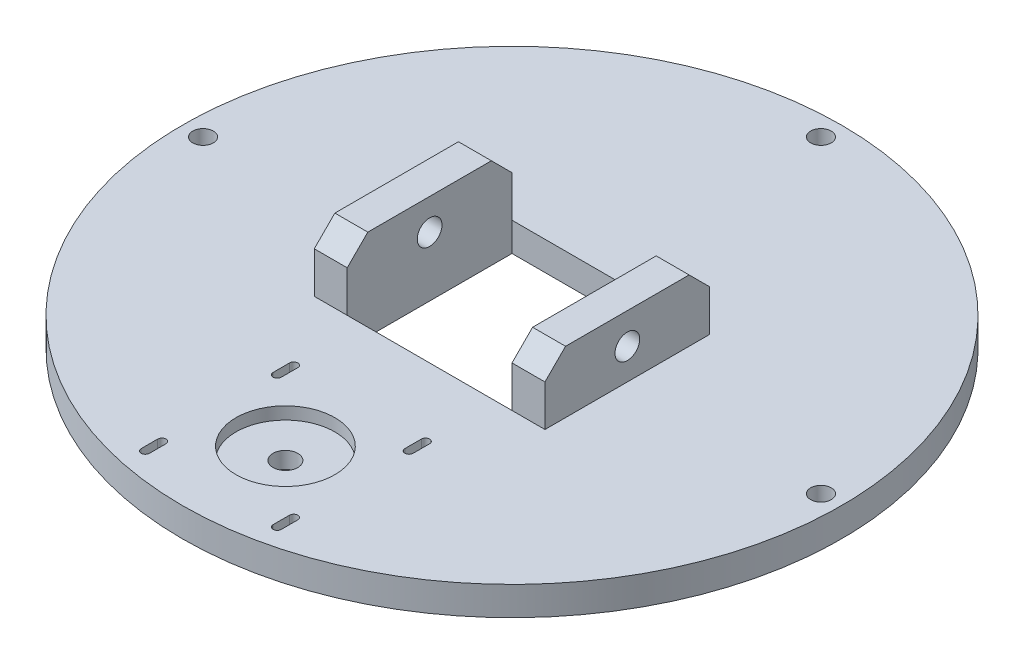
ISO-10303-21;
HEADER;
FILE_DESCRIPTION(('STEP AP214'),'2;1');
FILE_NAME('part.step','',(''),(''),'','','');
FILE_SCHEMA(('AUTOMOTIVE_DESIGN { 1 0 10303 214 1 1 1 1 }'));
ENDSEC;
DATA;
#1=APPLICATION_CONTEXT('core data for automotive mechanical design processes');
#2=APPLICATION_PROTOCOL_DEFINITION('international standard','automotive_design',2000,#1);
#3=PRODUCT_CONTEXT('',#1,'mechanical');
#4=PRODUCT('Part','Part','',(#3));
#5=PRODUCT_RELATED_PRODUCT_CATEGORY('part','',(#4));
#6=PRODUCT_DEFINITION_FORMATION('','',#4);
#7=PRODUCT_DEFINITION_CONTEXT('part definition',#1,'design');
#8=PRODUCT_DEFINITION('design','',#6,#7);
#9=PRODUCT_DEFINITION_SHAPE('','',#8);
#10=(LENGTH_UNIT() NAMED_UNIT(*) SI_UNIT(.MILLI.,.METRE.));
#11=(NAMED_UNIT(*) PLANE_ANGLE_UNIT() SI_UNIT($,.RADIAN.));
#12=(NAMED_UNIT(*) SI_UNIT($,.STERADIAN.) SOLID_ANGLE_UNIT());
#13=UNCERTAINTY_MEASURE_WITH_UNIT(LENGTH_MEASURE(1.E-05),#10,'distance_accuracy_value','');
#14=(GEOMETRIC_REPRESENTATION_CONTEXT(3) GLOBAL_UNCERTAINTY_ASSIGNED_CONTEXT((#13)) GLOBAL_UNIT_ASSIGNED_CONTEXT((#10,
#11,#12)) REPRESENTATION_CONTEXT('',''));
#15=CARTESIAN_POINT('',(0.,0.,0.));
#16=DIRECTION('',(0.,0.,1.));
#17=DIRECTION('',(1.,0.,0.));
#18=AXIS2_PLACEMENT_3D('',#15,#16,#17);
#19=CARTESIAN_POINT('',(0.,-0.00100000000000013,55.));
#20=DIRECTION('',(0.,1.,0.));
#21=DIRECTION('',(0.,0.,1.));
#22=AXIS2_PLACEMENT_3D('',#19,#20,#21);
#23=CYLINDRICAL_SURFACE('',#22,3.);
#24=CARTESIAN_POINT('',(0.,0.,55.));
#25=DIRECTION('',(0.,1.,0.));
#26=DIRECTION('',(0.,0.,1.));
#27=AXIS2_PLACEMENT_3D('',#24,#25,#26);
#28=CIRCLE('',#27,3.);
#29=CARTESIAN_POINT('',(0.,0.,58.));
#30=VERTEX_POINT('',#29);
#31=EDGE_CURVE('E360',#30,#30,#28,.F.);
#32=ORIENTED_EDGE('',*,*,#31,.T.);
#33=EDGE_LOOP('',(#32));
#34=FACE_BOUND('',#33,.T.);
#35=CARTESIAN_POINT('',(0.,4.,55.));
#36=DIRECTION('',(0.,1.,0.));
#37=DIRECTION('',(0.,0.,1.));
#38=AXIS2_PLACEMENT_3D('',#35,#36,#37);
#39=CIRCLE('',#38,3.);
#40=CARTESIAN_POINT('',(0.,4.,58.));
#41=VERTEX_POINT('',#40);
#42=EDGE_CURVE('E41',#41,#41,#39,.F.);
#43=ORIENTED_EDGE('',*,*,#42,.F.);
#44=EDGE_LOOP('',(#43));
#45=FACE_BOUND('',#44,.T.);
#46=ADVANCED_FACE('F37',(#34,#45),#23,.F.);
#47=CARTESIAN_POINT('',(16.0000000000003,-0.00100000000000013,73.));
#48=DIRECTION('',(0.,1.,0.));
#49=DIRECTION('',(0.,0.,1.));
#50=AXIS2_PLACEMENT_3D('',#47,#48,#49);
#51=CYLINDRICAL_SURFACE('',#50,1.);
#52=CARTESIAN_POINT('',(16.0000000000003,2.,73.));
#53=DIRECTION('',(0.,-1.,0.));
#54=DIRECTION('',(0.,0.,-1.));
#55=AXIS2_PLACEMENT_3D('',#52,#53,#54);
#56=CIRCLE('',#55,1.);
#57=CARTESIAN_POINT('',(15.0000000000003,2.,73.));
#58=VERTEX_POINT('',#57);
#59=CARTESIAN_POINT('',(17.0000000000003,2.,73.));
#60=VERTEX_POINT('',#59);
#61=EDGE_CURVE('E1238',#58,#60,#56,.F.);
#62=ORIENTED_EDGE('',*,*,#61,.F.);
#63=DIRECTION('',(0.,1.,0.));
#64=VECTOR('',#63,1.);
#65=CARTESIAN_POINT('',(15.0000000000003,-0.00100000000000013,73.));
#66=LINE('',#65,#64);
#67=CARTESIAN_POINT('',(15.0000000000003,7.,73.));
#68=VERTEX_POINT('',#67);
#69=EDGE_CURVE('E391',#58,#68,#66,.T.);
#70=ORIENTED_EDGE('',*,*,#69,.T.);
#71=CARTESIAN_POINT('',(16.0000000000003,7.,73.));
#72=DIRECTION('',(0.,1.,0.));
#73=DIRECTION('',(0.,0.,1.));
#74=AXIS2_PLACEMENT_3D('',#71,#72,#73);
#75=CIRCLE('',#74,1.);
#76=CARTESIAN_POINT('',(17.0000000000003,7.,73.));
#77=VERTEX_POINT('',#76);
#78=EDGE_CURVE('E377',#68,#77,#75,.T.);
#79=ORIENTED_EDGE('',*,*,#78,.T.);
#80=DIRECTION('',(0.,1.,0.));
#81=VECTOR('',#80,1.);
#82=CARTESIAN_POINT('',(17.0000000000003,-0.00100000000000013,73.));
#83=LINE('',#82,#81);
#84=EDGE_CURVE('E390',#60,#77,#83,.T.);
#85=ORIENTED_EDGE('',*,*,#84,.F.);
#86=EDGE_LOOP('',(#62,#70,#79,#85));
#87=FACE_BOUND('',#86,.T.);
#88=ADVANCED_FACE('F625',(#87),#51,.F.);
#89=CARTESIAN_POINT('',(15.0000000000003,-0.00100000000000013,73.));
#90=DIRECTION('',(1.,0.,0.));
#91=DIRECTION('',(0.,0.,-1.));
#92=AXIS2_PLACEMENT_3D('',#89,#90,#91);
#93=PLANE('',#92);
#94=ORIENTED_EDGE('',*,*,#69,.F.);
#95=DIRECTION('',(0.,0.,1.));
#96=VECTOR('',#95,1.);
#97=CARTESIAN_POINT('',(15.0000000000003,2.,0.));
#98=LINE('',#97,#96);
#99=CARTESIAN_POINT('',(15.0000000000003,2.,69.));
#100=VERTEX_POINT('',#99);
#101=EDGE_CURVE('E1241',#100,#58,#98,.T.);
#102=ORIENTED_EDGE('',*,*,#101,.F.);
#103=DIRECTION('',(0.,1.,0.));
#104=VECTOR('',#103,1.);
#105=CARTESIAN_POINT('',(15.0000000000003,-0.00100000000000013,69.));
#106=LINE('',#105,#104);
#107=CARTESIAN_POINT('',(15.0000000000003,7.,69.));
#108=VERTEX_POINT('',#107);
#109=EDGE_CURVE('E394',#100,#108,#106,.T.);
#110=ORIENTED_EDGE('',*,*,#109,.T.);
#111=DIRECTION('',(0.,0.,-1.));
#112=VECTOR('',#111,1.);
#113=CARTESIAN_POINT('',(15.0000000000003,7.,73.));
#114=LINE('',#113,#112);
#115=EDGE_CURVE('E387',#68,#108,#114,.T.);
#116=ORIENTED_EDGE('',*,*,#115,.F.);
#117=EDGE_LOOP('',(#94,#102,#110,#116));
#118=FACE_BOUND('',#117,.T.);
#119=ADVANCED_FACE('F631',(#118),#93,.T.);
#120=CARTESIAN_POINT('',(16.0000000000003,-0.00100000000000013,69.));
#121=DIRECTION('',(0.,1.,0.));
#122=DIRECTION('',(0.,0.,1.));
#123=AXIS2_PLACEMENT_3D('',#120,#121,#122);
#124=CYLINDRICAL_SURFACE('',#123,1.);
#125=CARTESIAN_POINT('',(16.0000000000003,2.,69.));
#126=DIRECTION('',(0.,-1.,0.));
#127=DIRECTION('',(0.,0.,-1.));
#128=AXIS2_PLACEMENT_3D('',#125,#126,#127);
#129=CIRCLE('',#128,1.);
#130=CARTESIAN_POINT('',(17.0000000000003,2.,69.));
#131=VERTEX_POINT('',#130);
#132=EDGE_CURVE('E1244',#131,#100,#129,.F.);
#133=ORIENTED_EDGE('',*,*,#132,.F.);
#134=DIRECTION('',(0.,1.,0.));
#135=VECTOR('',#134,1.);
#136=CARTESIAN_POINT('',(17.0000000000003,-0.00100000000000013,69.));
#137=LINE('',#136,#135);
#138=CARTESIAN_POINT('',(17.0000000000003,7.,69.));
#139=VERTEX_POINT('',#138);
#140=EDGE_CURVE('E396',#131,#139,#137,.T.);
#141=ORIENTED_EDGE('',*,*,#140,.T.);
#142=CARTESIAN_POINT('',(16.0000000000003,7.,69.));
#143=DIRECTION('',(0.,1.,0.));
#144=DIRECTION('',(0.,0.,1.));
#145=AXIS2_PLACEMENT_3D('',#142,#143,#144);
#146=CIRCLE('',#145,1.);
#147=EDGE_CURVE('E384',#139,#108,#146,.T.);
#148=ORIENTED_EDGE('',*,*,#147,.T.);
#149=ORIENTED_EDGE('',*,*,#109,.F.);
#150=EDGE_LOOP('',(#133,#141,#148,#149));
#151=FACE_BOUND('',#150,.T.);
#152=ADVANCED_FACE('F640',(#151),#124,.F.);
#153=CARTESIAN_POINT('',(17.0000000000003,-0.00100000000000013,73.));
#154=DIRECTION('',(1.,0.,0.));
#155=DIRECTION('',(0.,0.,-1.));
#156=AXIS2_PLACEMENT_3D('',#153,#154,#155);
#157=PLANE('',#156);
#158=DIRECTION('',(0.,0.,-1.));
#159=VECTOR('',#158,1.);
#160=CARTESIAN_POINT('',(17.0000000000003,2.,0.));
#161=LINE('',#160,#159);
#162=EDGE_CURVE('E1246',#60,#131,#161,.T.);
#163=ORIENTED_EDGE('',*,*,#162,.F.);
#164=ORIENTED_EDGE('',*,*,#84,.T.);
#165=DIRECTION('',(0.,0.,-1.));
#166=VECTOR('',#165,1.);
#167=CARTESIAN_POINT('',(17.0000000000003,7.,73.));
#168=LINE('',#167,#166);
#169=EDGE_CURVE('E380',#77,#139,#168,.T.);
#170=ORIENTED_EDGE('',*,*,#169,.T.);
#171=ORIENTED_EDGE('',*,*,#140,.F.);
#172=EDGE_LOOP('',(#163,#164,#170,#171));
#173=FACE_BOUND('',#172,.T.);
#174=ADVANCED_FACE('F644',(#173),#157,.F.);
#175=CARTESIAN_POINT('',(-15.9999999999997,-0.00100000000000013,73.));
#176=DIRECTION('',(0.,1.,0.));
#177=DIRECTION('',(0.,0.,1.));
#178=AXIS2_PLACEMENT_3D('',#175,#176,#177);
#179=CYLINDRICAL_SURFACE('',#178,1.);
#180=CARTESIAN_POINT('',(-15.9999999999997,2.,73.));
#181=DIRECTION('',(0.,-1.,0.));
#182=DIRECTION('',(0.,0.,-1.));
#183=AXIS2_PLACEMENT_3D('',#180,#181,#182);
#184=CIRCLE('',#183,1.);
#185=CARTESIAN_POINT('',(-16.9999999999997,2.,73.));
#186=VERTEX_POINT('',#185);
#187=CARTESIAN_POINT('',(-14.9999999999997,2.,73.));
#188=VERTEX_POINT('',#187);
#189=EDGE_CURVE('E1324',#186,#188,#184,.F.);
#190=ORIENTED_EDGE('',*,*,#189,.F.);
#191=DIRECTION('',(0.,1.,0.));
#192=VECTOR('',#191,1.);
#193=CARTESIAN_POINT('',(-16.9999999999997,-0.00100000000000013,73.));
#194=LINE('',#193,#192);
#195=CARTESIAN_POINT('',(-16.9999999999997,7.,73.));
#196=VERTEX_POINT('',#195);
#197=EDGE_CURVE('E1363',#186,#196,#194,.T.);
#198=ORIENTED_EDGE('',*,*,#197,.T.);
#199=CARTESIAN_POINT('',(-15.9999999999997,7.,73.));
#200=DIRECTION('',(0.,1.,0.));
#201=DIRECTION('',(0.,0.,1.));
#202=AXIS2_PLACEMENT_3D('',#199,#200,#201);
#203=CIRCLE('',#202,1.);
#204=CARTESIAN_POINT('',(-14.9999999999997,7.,73.));
#205=VERTEX_POINT('',#204);
#206=EDGE_CURVE('E381',#196,#205,#203,.T.);
#207=ORIENTED_EDGE('',*,*,#206,.T.);
#208=DIRECTION('',(0.,1.,0.));
#209=VECTOR('',#208,1.);
#210=CARTESIAN_POINT('',(-14.9999999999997,-0.00100000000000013,73.));
#211=LINE('',#210,#209);
#212=EDGE_CURVE('E1356',#188,#205,#211,.T.);
#213=ORIENTED_EDGE('',*,*,#212,.F.);
#214=EDGE_LOOP('',(#190,#198,#207,#213));
#215=FACE_BOUND('',#214,.T.);
#216=ADVANCED_FACE('F647',(#215),#179,.F.);
#217=CARTESIAN_POINT('',(-16.9999999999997,-0.00100000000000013,73.));
#218=DIRECTION('',(1.,0.,0.));
#219=DIRECTION('',(0.,0.,-1.));
#220=AXIS2_PLACEMENT_3D('',#217,#218,#219);
#221=PLANE('',#220);
#222=ORIENTED_EDGE('',*,*,#197,.F.);
#223=DIRECTION('',(0.,0.,1.));
#224=VECTOR('',#223,1.);
#225=CARTESIAN_POINT('',(-16.9999999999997,2.,0.));
#226=LINE('',#225,#224);
#227=CARTESIAN_POINT('',(-16.9999999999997,2.,69.));
#228=VERTEX_POINT('',#227);
#229=EDGE_CURVE('E1321',#228,#186,#226,.T.);
#230=ORIENTED_EDGE('',*,*,#229,.F.);
#231=DIRECTION('',(0.,1.,0.));
#232=VECTOR('',#231,1.);
#233=CARTESIAN_POINT('',(-16.9999999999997,-0.00100000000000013,69.));
#234=LINE('',#233,#232);
#235=CARTESIAN_POINT('',(-16.9999999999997,7.,69.));
#236=VERTEX_POINT('',#235);
#237=EDGE_CURVE('E1361',#228,#236,#234,.T.);
#238=ORIENTED_EDGE('',*,*,#237,.T.);
#239=DIRECTION('',(0.,0.,-1.));
#240=VECTOR('',#239,1.);
#241=CARTESIAN_POINT('',(-16.9999999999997,7.,73.));
#242=LINE('',#241,#240);
#243=EDGE_CURVE('E1358',#196,#236,#242,.T.);
#244=ORIENTED_EDGE('',*,*,#243,.F.);
#245=EDGE_LOOP('',(#222,#230,#238,#244));
#246=FACE_BOUND('',#245,.T.);
#247=ADVANCED_FACE('F977',(#246),#221,.T.);
#248=CARTESIAN_POINT('',(-15.9999999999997,-0.00100000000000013,69.));
#249=DIRECTION('',(0.,1.,0.));
#250=DIRECTION('',(0.,0.,1.));
#251=AXIS2_PLACEMENT_3D('',#248,#249,#250);
#252=CYLINDRICAL_SURFACE('',#251,1.);
#253=CARTESIAN_POINT('',(-15.9999999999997,2.,69.));
#254=DIRECTION('',(0.,-1.,0.));
#255=DIRECTION('',(0.,0.,-1.));
#256=AXIS2_PLACEMENT_3D('',#253,#254,#255);
#257=CIRCLE('',#256,1.);
#258=CARTESIAN_POINT('',(-14.9999999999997,2.,69.));
#259=VERTEX_POINT('',#258);
#260=EDGE_CURVE('E1319',#259,#228,#257,.F.);
#261=ORIENTED_EDGE('',*,*,#260,.F.);
#262=DIRECTION('',(0.,1.,0.));
#263=VECTOR('',#262,1.);
#264=CARTESIAN_POINT('',(-14.9999999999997,-0.00100000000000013,69.));
#265=LINE('',#264,#263);
#266=CARTESIAN_POINT('',(-14.9999999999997,7.,69.));
#267=VERTEX_POINT('',#266);
#268=EDGE_CURVE('E1359',#259,#267,#265,.T.);
#269=ORIENTED_EDGE('',*,*,#268,.T.);
#270=CARTESIAN_POINT('',(-15.9999999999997,7.,69.));
#271=DIRECTION('',(0.,1.,0.));
#272=DIRECTION('',(0.,0.,1.));
#273=AXIS2_PLACEMENT_3D('',#270,#271,#272);
#274=CIRCLE('',#273,1.);
#275=EDGE_CURVE('E1366',#267,#236,#274,.T.);
#276=ORIENTED_EDGE('',*,*,#275,.T.);
#277=ORIENTED_EDGE('',*,*,#237,.F.);
#278=EDGE_LOOP('',(#261,#269,#276,#277));
#279=FACE_BOUND('',#278,.T.);
#280=ADVANCED_FACE('F986',(#279),#252,.F.);
#281=CARTESIAN_POINT('',(-14.9999999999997,-0.00100000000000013,73.));
#282=DIRECTION('',(1.,0.,0.));
#283=DIRECTION('',(0.,0.,-1.));
#284=AXIS2_PLACEMENT_3D('',#281,#282,#283);
#285=PLANE('',#284);
#286=DIRECTION('',(0.,0.,-1.));
#287=VECTOR('',#286,1.);
#288=CARTESIAN_POINT('',(-14.9999999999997,2.,0.));
#289=LINE('',#288,#287);
#290=EDGE_CURVE('E1326',#188,#259,#289,.T.);
#291=ORIENTED_EDGE('',*,*,#290,.F.);
#292=ORIENTED_EDGE('',*,*,#212,.T.);
#293=DIRECTION('',(0.,0.,-1.));
#294=VECTOR('',#293,1.);
#295=CARTESIAN_POINT('',(-14.9999999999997,7.,73.));
#296=LINE('',#295,#294);
#297=EDGE_CURVE('E1369',#205,#267,#296,.T.);
#298=ORIENTED_EDGE('',*,*,#297,.T.);
#299=ORIENTED_EDGE('',*,*,#268,.F.);
#300=EDGE_LOOP('',(#291,#292,#298,#299));
#301=FACE_BOUND('',#300,.T.);
#302=ADVANCED_FACE('F995',(#301),#285,.F.);
#303=CARTESIAN_POINT('',(-16.,-0.00100000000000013,41.));
#304=DIRECTION('',(0.,1.,0.));
#305=DIRECTION('',(0.,0.,1.));
#306=AXIS2_PLACEMENT_3D('',#303,#304,#305);
#307=CYLINDRICAL_SURFACE('',#306,1.);
#308=CARTESIAN_POINT('',(-16.,2.,41.));
#309=DIRECTION('',(0.,-1.,0.));
#310=DIRECTION('',(0.,0.,-1.));
#311=AXIS2_PLACEMENT_3D('',#308,#309,#310);
#312=CIRCLE('',#311,1.);
#313=CARTESIAN_POINT('',(-17.,2.,41.));
#314=VERTEX_POINT('',#313);
#315=CARTESIAN_POINT('',(-15.,2.,41.));
#316=VERTEX_POINT('',#315);
#317=EDGE_CURVE('E1287',#314,#316,#312,.F.);
#318=ORIENTED_EDGE('',*,*,#317,.F.);
#319=DIRECTION('',(0.,1.,0.));
#320=VECTOR('',#319,1.);
#321=CARTESIAN_POINT('',(-17.,-0.00100000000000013,41.));
#322=LINE('',#321,#320);
#323=CARTESIAN_POINT('',(-17.,7.,41.));
#324=VERTEX_POINT('',#323);
#325=EDGE_CURVE('E373',#314,#324,#322,.T.);
#326=ORIENTED_EDGE('',*,*,#325,.T.);
#327=CARTESIAN_POINT('',(-16.,7.,41.));
#328=DIRECTION('',(0.,1.,0.));
#329=DIRECTION('',(0.,0.,1.));
#330=AXIS2_PLACEMENT_3D('',#327,#328,#329);
#331=CIRCLE('',#330,1.);
#332=CARTESIAN_POINT('',(-15.,7.,41.));
#333=VERTEX_POINT('',#332);
#334=EDGE_CURVE('E1225',#324,#333,#331,.T.);
#335=ORIENTED_EDGE('',*,*,#334,.T.);
#336=DIRECTION('',(0.,1.,0.));
#337=VECTOR('',#336,1.);
#338=CARTESIAN_POINT('',(-15.,-0.00100000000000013,41.));
#339=LINE('',#338,#337);
#340=EDGE_CURVE('E1373',#316,#333,#339,.T.);
#341=ORIENTED_EDGE('',*,*,#340,.F.);
#342=EDGE_LOOP('',(#318,#326,#335,#341));
#343=FACE_BOUND('',#342,.T.);
#344=ADVANCED_FACE('F1004',(#343),#307,.F.);
#345=CARTESIAN_POINT('',(-17.,-0.00100000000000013,41.));
#346=DIRECTION('',(1.,0.,0.));
#347=DIRECTION('',(0.,0.,-1.));
#348=AXIS2_PLACEMENT_3D('',#345,#346,#347);
#349=PLANE('',#348);
#350=ORIENTED_EDGE('',*,*,#325,.F.);
#351=DIRECTION('',(0.,0.,1.));
#352=VECTOR('',#351,1.);
#353=CARTESIAN_POINT('',(-17.,2.,0.));
#354=LINE('',#353,#352);
#355=CARTESIAN_POINT('',(-17.,2.,37.));
#356=VERTEX_POINT('',#355);
#357=EDGE_CURVE('E1284',#356,#314,#354,.T.);
#358=ORIENTED_EDGE('',*,*,#357,.F.);
#359=DIRECTION('',(0.,1.,0.));
#360=VECTOR('',#359,1.);
#361=CARTESIAN_POINT('',(-17.,-0.00100000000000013,37.));
#362=LINE('',#361,#360);
#363=CARTESIAN_POINT('',(-17.,7.,37.));
#364=VERTEX_POINT('',#363);
#365=EDGE_CURVE('E1378',#356,#364,#362,.T.);
#366=ORIENTED_EDGE('',*,*,#365,.T.);
#367=DIRECTION('',(0.,0.,-1.));
#368=VECTOR('',#367,1.);
#369=CARTESIAN_POINT('',(-17.,7.,41.));
#370=LINE('',#369,#368);
#371=EDGE_CURVE('E1375',#324,#364,#370,.T.);
#372=ORIENTED_EDGE('',*,*,#371,.F.);
#373=EDGE_LOOP('',(#350,#358,#366,#372));
#374=FACE_BOUND('',#373,.T.);
#375=ADVANCED_FACE('F1013',(#374),#349,.T.);
#376=CARTESIAN_POINT('',(-16.,-0.00100000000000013,37.));
#377=DIRECTION('',(0.,1.,0.));
#378=DIRECTION('',(0.,0.,1.));
#379=AXIS2_PLACEMENT_3D('',#376,#377,#378);
#380=CYLINDRICAL_SURFACE('',#379,1.);
#381=CARTESIAN_POINT('',(-16.,2.,37.));
#382=DIRECTION('',(0.,-1.,0.));
#383=DIRECTION('',(0.,0.,-1.));
#384=AXIS2_PLACEMENT_3D('',#381,#382,#383);
#385=CIRCLE('',#384,1.);
#386=CARTESIAN_POINT('',(-15.,2.,37.));
#387=VERTEX_POINT('',#386);
#388=EDGE_CURVE('E1282',#387,#356,#385,.F.);
#389=ORIENTED_EDGE('',*,*,#388,.F.);
#390=DIRECTION('',(0.,1.,0.));
#391=VECTOR('',#390,1.);
#392=CARTESIAN_POINT('',(-15.,-0.00100000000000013,37.));
#393=LINE('',#392,#391);
#394=CARTESIAN_POINT('',(-15.,7.,37.));
#395=VERTEX_POINT('',#394);
#396=EDGE_CURVE('E1376',#387,#395,#393,.T.);
#397=ORIENTED_EDGE('',*,*,#396,.T.);
#398=CARTESIAN_POINT('',(-16.,7.,37.));
#399=DIRECTION('',(0.,1.,0.));
#400=DIRECTION('',(0.,0.,1.));
#401=AXIS2_PLACEMENT_3D('',#398,#399,#400);
#402=CIRCLE('',#401,1.);
#403=EDGE_CURVE('E1382',#395,#364,#402,.T.);
#404=ORIENTED_EDGE('',*,*,#403,.T.);
#405=ORIENTED_EDGE('',*,*,#365,.F.);
#406=EDGE_LOOP('',(#389,#397,#404,#405));
#407=FACE_BOUND('',#406,.T.);
#408=ADVANCED_FACE('F1022',(#407),#380,.F.);
#409=CARTESIAN_POINT('',(-15.,-0.00100000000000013,41.));
#410=DIRECTION('',(1.,0.,0.));
#411=DIRECTION('',(0.,0.,-1.));
#412=AXIS2_PLACEMENT_3D('',#409,#410,#411);
#413=PLANE('',#412);
#414=DIRECTION('',(0.,0.,-1.));
#415=VECTOR('',#414,1.);
#416=CARTESIAN_POINT('',(-15.,2.,0.));
#417=LINE('',#416,#415);
#418=EDGE_CURVE('E1289',#316,#387,#417,.T.);
#419=ORIENTED_EDGE('',*,*,#418,.F.);
#420=ORIENTED_EDGE('',*,*,#340,.T.);
#421=DIRECTION('',(0.,0.,-1.));
#422=VECTOR('',#421,1.);
#423=CARTESIAN_POINT('',(-15.,7.,41.));
#424=LINE('',#423,#422);
#425=EDGE_CURVE('E1385',#333,#395,#424,.T.);
#426=ORIENTED_EDGE('',*,*,#425,.T.);
#427=ORIENTED_EDGE('',*,*,#396,.F.);
#428=EDGE_LOOP('',(#419,#420,#426,#427));
#429=FACE_BOUND('',#428,.T.);
#430=ADVANCED_FACE('F1031',(#429),#413,.F.);
#431=CARTESIAN_POINT('',(16.,-0.00100000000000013,41.));
#432=DIRECTION('',(0.,1.,0.));
#433=DIRECTION('',(0.,0.,1.));
#434=AXIS2_PLACEMENT_3D('',#431,#432,#433);
#435=CYLINDRICAL_SURFACE('',#434,1.);
#436=CARTESIAN_POINT('',(16.,2.,41.));
#437=DIRECTION('',(0.,-1.,0.));
#438=DIRECTION('',(0.,0.,-1.));
#439=AXIS2_PLACEMENT_3D('',#436,#437,#438);
#440=CIRCLE('',#439,1.);
#441=CARTESIAN_POINT('',(15.,2.,41.));
#442=VERTEX_POINT('',#441);
#443=CARTESIAN_POINT('',(17.,2.,41.));
#444=VERTEX_POINT('',#443);
#445=EDGE_CURVE('E350',#442,#444,#440,.F.);
#446=ORIENTED_EDGE('',*,*,#445,.F.);
#447=DIRECTION('',(0.,1.,0.));
#448=VECTOR('',#447,1.);
#449=CARTESIAN_POINT('',(15.,-0.00100000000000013,41.));
#450=LINE('',#449,#448);
#451=CARTESIAN_POINT('',(15.,7.,41.));
#452=VERTEX_POINT('',#451);
#453=EDGE_CURVE('E349',#442,#452,#450,.T.);
#454=ORIENTED_EDGE('',*,*,#453,.T.);
#455=CARTESIAN_POINT('',(16.,7.,41.));
#456=DIRECTION('',(0.,1.,0.));
#457=DIRECTION('',(0.,0.,1.));
#458=AXIS2_PLACEMENT_3D('',#455,#456,#457);
#459=CIRCLE('',#458,1.);
#460=CARTESIAN_POINT('',(17.,7.,41.));
#461=VERTEX_POINT('',#460);
#462=EDGE_CURVE('E370',#452,#461,#459,.T.);
#463=ORIENTED_EDGE('',*,*,#462,.T.);
#464=DIRECTION('',(0.,1.,0.));
#465=VECTOR('',#464,1.);
#466=CARTESIAN_POINT('',(17.,-0.00100000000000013,41.));
#467=LINE('',#466,#465);
#468=EDGE_CURVE('E358',#444,#461,#467,.T.);
#469=ORIENTED_EDGE('',*,*,#468,.F.);
#470=EDGE_LOOP('',(#446,#454,#463,#469));
#471=FACE_BOUND('',#470,.T.);
#472=ADVANCED_FACE('F1040',(#471),#435,.F.);
#473=CARTESIAN_POINT('',(15.,-0.00100000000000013,41.));
#474=DIRECTION('',(1.,0.,0.));
#475=DIRECTION('',(0.,0.,-1.));
#476=AXIS2_PLACEMENT_3D('',#473,#474,#475);
#477=PLANE('',#476);
#478=ORIENTED_EDGE('',*,*,#453,.F.);
#479=DIRECTION('',(0.,0.,1.));
#480=VECTOR('',#479,1.);
#481=CARTESIAN_POINT('',(15.,2.,0.));
#482=LINE('',#481,#480);
#483=CARTESIAN_POINT('',(15.,2.,37.));
#484=VERTEX_POINT('',#483);
#485=EDGE_CURVE('E334',#484,#442,#482,.T.);
#486=ORIENTED_EDGE('',*,*,#485,.F.);
#487=DIRECTION('',(0.,1.,0.));
#488=VECTOR('',#487,1.);
#489=CARTESIAN_POINT('',(15.,-0.00100000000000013,37.));
#490=LINE('',#489,#488);
#491=CARTESIAN_POINT('',(15.,7.,37.));
#492=VERTEX_POINT('',#491);
#493=EDGE_CURVE('E347',#484,#492,#490,.T.);
#494=ORIENTED_EDGE('',*,*,#493,.T.);
#495=DIRECTION('',(0.,0.,-1.));
#496=VECTOR('',#495,1.);
#497=CARTESIAN_POINT('',(15.,7.,41.));
#498=LINE('',#497,#496);
#499=EDGE_CURVE('E364',#452,#492,#498,.T.);
#500=ORIENTED_EDGE('',*,*,#499,.F.);
#501=EDGE_LOOP('',(#478,#486,#494,#500));
#502=FACE_BOUND('',#501,.T.);
#503=ADVANCED_FACE('F345',(#502),#477,.T.);
#504=CARTESIAN_POINT('',(16.,-0.00100000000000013,37.));
#505=DIRECTION('',(0.,1.,0.));
#506=DIRECTION('',(0.,0.,1.));
#507=AXIS2_PLACEMENT_3D('',#504,#505,#506);
#508=CYLINDRICAL_SURFACE('',#507,1.);
#509=CARTESIAN_POINT('',(16.,2.,37.));
#510=DIRECTION('',(0.,-1.,0.));
#511=DIRECTION('',(0.,0.,-1.));
#512=AXIS2_PLACEMENT_3D('',#509,#510,#511);
#513=CIRCLE('',#512,1.);
#514=CARTESIAN_POINT('',(17.,2.,37.));
#515=VERTEX_POINT('',#514);
#516=EDGE_CURVE('E330',#515,#484,#513,.F.);
#517=ORIENTED_EDGE('',*,*,#516,.F.);
#518=DIRECTION('',(0.,1.,0.));
#519=VECTOR('',#518,1.);
#520=CARTESIAN_POINT('',(17.,-0.00100000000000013,37.));
#521=LINE('',#520,#519);
#522=CARTESIAN_POINT('',(17.,7.,37.));
#523=VERTEX_POINT('',#522);
#524=EDGE_CURVE('E356',#515,#523,#521,.T.);
#525=ORIENTED_EDGE('',*,*,#524,.T.);
#526=CARTESIAN_POINT('',(16.,7.,37.));
#527=DIRECTION('',(0.,1.,0.));
#528=DIRECTION('',(0.,0.,1.));
#529=AXIS2_PLACEMENT_3D('',#526,#527,#528);
#530=CIRCLE('',#529,1.);
#531=EDGE_CURVE('E354',#523,#492,#530,.T.);
#532=ORIENTED_EDGE('',*,*,#531,.T.);
#533=ORIENTED_EDGE('',*,*,#493,.F.);
#534=EDGE_LOOP('',(#517,#525,#532,#533));
#535=FACE_BOUND('',#534,.T.);
#536=ADVANCED_FACE('F352',(#535),#508,.F.);
#537=CARTESIAN_POINT('',(17.,-0.00100000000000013,41.));
#538=DIRECTION('',(1.,0.,0.));
#539=DIRECTION('',(0.,0.,-1.));
#540=AXIS2_PLACEMENT_3D('',#537,#538,#539);
#541=PLANE('',#540);
#542=DIRECTION('',(0.,0.,-1.));
#543=VECTOR('',#542,1.);
#544=CARTESIAN_POINT('',(17.,2.,0.));
#545=LINE('',#544,#543);
#546=EDGE_CURVE('E337',#444,#515,#545,.T.);
#547=ORIENTED_EDGE('',*,*,#546,.F.);
#548=ORIENTED_EDGE('',*,*,#468,.T.);
#549=DIRECTION('',(0.,0.,-1.));
#550=VECTOR('',#549,1.);
#551=CARTESIAN_POINT('',(17.,7.,41.));
#552=LINE('',#551,#550);
#553=EDGE_CURVE('E367',#461,#523,#552,.T.);
#554=ORIENTED_EDGE('',*,*,#553,.T.);
#555=ORIENTED_EDGE('',*,*,#524,.F.);
#556=EDGE_LOOP('',(#547,#548,#554,#555));
#557=FACE_BOUND('',#556,.T.);
#558=ADVANCED_FACE('F1063',(#557),#541,.F.);
#559=CARTESIAN_POINT('',(0.,7.,0.));
#560=DIRECTION('',(0.,-1.,0.));
#561=DIRECTION('',(0.,0.,-1.));
#562=AXIS2_PLACEMENT_3D('',#559,#560,#561);
#563=CYLINDRICAL_SURFACE('',#562,80.);
#564=CARTESIAN_POINT('',(0.,7.,0.));
#565=DIRECTION('',(0.,1.,0.));
#566=DIRECTION('',(0.,0.,1.));
#567=AXIS2_PLACEMENT_3D('',#564,#565,#566);
#568=CIRCLE('',#567,80.);
#569=CARTESIAN_POINT('',(0.,7.,80.));
#570=VERTEX_POINT('',#569);
#571=EDGE_CURVE('E504',#570,#570,#568,.T.);
#572=ORIENTED_EDGE('',*,*,#571,.F.);
#573=EDGE_LOOP('',(#572));
#574=FACE_BOUND('',#573,.T.);
#575=CARTESIAN_POINT('',(0.,0.,0.));
#576=DIRECTION('',(0.,1.,0.));
#577=DIRECTION('',(0.,0.,1.));
#578=AXIS2_PLACEMENT_3D('',#575,#576,#577);
#579=CIRCLE('',#578,80.);
#580=CARTESIAN_POINT('',(0.,0.,80.));
#581=VERTEX_POINT('',#580);
#582=EDGE_CURVE('E493',#581,#581,#579,.T.);
#583=ORIENTED_EDGE('',*,*,#582,.T.);
#584=EDGE_LOOP('',(#583));
#585=FACE_BOUND('',#584,.T.);
#586=ADVANCED_FACE('F1069',(#574,#585),#563,.T.);
#587=CARTESIAN_POINT('',(0.,7.,0.));
#588=DIRECTION('',(0.,1.,0.));
#589=DIRECTION('',(0.,0.,1.));
#590=AXIS2_PLACEMENT_3D('',#587,#588,#589);
#591=PLANE('',#590);
#592=CARTESIAN_POINT('',(0.,7.,55.));
#593=DIRECTION('',(0.,1.,0.));
#594=DIRECTION('',(0.,0.,1.));
#595=AXIS2_PLACEMENT_3D('',#592,#593,#594);
#596=CIRCLE('',#595,12.);
#597=CARTESIAN_POINT('',(0.,7.,67.));
#598=VERTEX_POINT('',#597);
#599=EDGE_CURVE('E1216',#598,#598,#596,.T.);
#600=ORIENTED_EDGE('',*,*,#599,.F.);
#601=EDGE_LOOP('',(#600));
#602=FACE_BOUND('',#601,.T.);
#603=ORIENTED_EDGE('',*,*,#462,.F.);
#604=ORIENTED_EDGE('',*,*,#499,.T.);
#605=ORIENTED_EDGE('',*,*,#531,.F.);
#606=ORIENTED_EDGE('',*,*,#553,.F.);
#607=EDGE_LOOP('',(#603,#604,#605,#606));
#608=FACE_BOUND('',#607,.T.);
#609=ORIENTED_EDGE('',*,*,#334,.F.);
#610=ORIENTED_EDGE('',*,*,#371,.T.);
#611=ORIENTED_EDGE('',*,*,#403,.F.);
#612=ORIENTED_EDGE('',*,*,#425,.F.);
#613=EDGE_LOOP('',(#609,#610,#611,#612));
#614=FACE_BOUND('',#613,.T.);
#615=ORIENTED_EDGE('',*,*,#206,.F.);
#616=ORIENTED_EDGE('',*,*,#243,.T.);
#617=ORIENTED_EDGE('',*,*,#275,.F.);
#618=ORIENTED_EDGE('',*,*,#297,.F.);
#619=EDGE_LOOP('',(#615,#616,#617,#618));
#620=FACE_BOUND('',#619,.T.);
#621=ORIENTED_EDGE('',*,*,#78,.F.);
#622=ORIENTED_EDGE('',*,*,#115,.T.);
#623=ORIENTED_EDGE('',*,*,#147,.F.);
#624=ORIENTED_EDGE('',*,*,#169,.F.);
#625=EDGE_LOOP('',(#621,#622,#623,#624));
#626=FACE_BOUND('',#625,.T.);
#627=DIRECTION('',(-1.,0.,0.));
#628=VECTOR('',#627,1.);
#629=CARTESIAN_POINT('',(20.,7.,20.));
#630=LINE('',#629,#628);
#631=CARTESIAN_POINT('',(28.,7.,20.));
#632=VERTEX_POINT('',#631);
#633=CARTESIAN_POINT('',(20.,7.,20.));
#634=VERTEX_POINT('',#633);
#635=EDGE_CURVE('E402',#632,#634,#630,.T.);
#636=ORIENTED_EDGE('',*,*,#635,.T.);
#637=DIRECTION('',(1.,0.,0.));
#638=VECTOR('',#637,1.);
#639=CARTESIAN_POINT('',(-20.,7.,20.));
#640=LINE('',#639,#638);
#641=CARTESIAN_POINT('',(-20.,7.,20.));
#642=VERTEX_POINT('',#641);
#643=EDGE_CURVE('E464',#642,#634,#640,.T.);
#644=ORIENTED_EDGE('',*,*,#643,.F.);
#645=DIRECTION('',(1.,0.,0.));
#646=VECTOR('',#645,1.);
#647=CARTESIAN_POINT('',(-20.,7.,20.));
#648=LINE('',#647,#646);
#649=CARTESIAN_POINT('',(-28.,7.,20.));
#650=VERTEX_POINT('',#649);
#651=EDGE_CURVE('E438',#650,#642,#648,.T.);
#652=ORIENTED_EDGE('',*,*,#651,.F.);
#653=DIRECTION('',(0.,0.,1.));
#654=VECTOR('',#653,1.);
#655=CARTESIAN_POINT('',(-28.,7.,-20.));
#656=LINE('',#655,#654);
#657=CARTESIAN_POINT('',(-28.,7.,-20.));
#658=VERTEX_POINT('',#657);
#659=EDGE_CURVE('E444',#658,#650,#656,.T.);
#660=ORIENTED_EDGE('',*,*,#659,.F.);
#661=DIRECTION('',(-1.,0.,0.));
#662=VECTOR('',#661,1.);
#663=CARTESIAN_POINT('',(-20.,7.,-20.));
#664=LINE('',#663,#662);
#665=CARTESIAN_POINT('',(-20.,7.,-20.));
#666=VERTEX_POINT('',#665);
#667=EDGE_CURVE('E433',#666,#658,#664,.T.);
#668=ORIENTED_EDGE('',*,*,#667,.F.);
#669=DIRECTION('',(-1.,0.,0.));
#670=VECTOR('',#669,1.);
#671=CARTESIAN_POINT('',(-20.,7.,-20.));
#672=LINE('',#671,#670);
#673=CARTESIAN_POINT('',(20.,7.,-20.));
#674=VERTEX_POINT('',#673);
#675=EDGE_CURVE('E467',#674,#666,#672,.T.);
#676=ORIENTED_EDGE('',*,*,#675,.F.);
#677=DIRECTION('',(1.,0.,0.));
#678=VECTOR('',#677,1.);
#679=CARTESIAN_POINT('',(20.,7.,-20.));
#680=LINE('',#679,#678);
#681=CARTESIAN_POINT('',(28.,7.,-20.));
#682=VERTEX_POINT('',#681);
#683=EDGE_CURVE('E409',#674,#682,#680,.T.);
#684=ORIENTED_EDGE('',*,*,#683,.T.);
#685=DIRECTION('',(0.,0.,1.));
#686=VECTOR('',#685,1.);
#687=CARTESIAN_POINT('',(28.,7.,-20.));
#688=LINE('',#687,#686);
#689=EDGE_CURVE('E415',#682,#632,#688,.T.);
#690=ORIENTED_EDGE('',*,*,#689,.T.);
#691=EDGE_LOOP('',(#636,#644,#652,#660,#668,#676,#684,#690));
#692=FACE_BOUND('',#691,.T.);
#693=CARTESIAN_POINT('',(-75.,7.,0.));
#694=DIRECTION('',(0.,1.,0.));
#695=DIRECTION('',(0.,0.,1.));
#696=AXIS2_PLACEMENT_3D('',#693,#694,#695);
#697=CIRCLE('',#696,2.5);
#698=CARTESIAN_POINT('',(-75.,7.,2.5));
#699=VERTEX_POINT('',#698);
#700=EDGE_CURVE('E486',#699,#699,#697,.T.);
#701=ORIENTED_EDGE('',*,*,#700,.F.);
#702=EDGE_LOOP('',(#701));
#703=FACE_BOUND('',#702,.T.);
#704=CARTESIAN_POINT('',(0.,7.,-75.));
#705=DIRECTION('',(0.,1.,0.));
#706=DIRECTION('',(0.,0.,1.));
#707=AXIS2_PLACEMENT_3D('',#704,#705,#706);
#708=CIRCLE('',#707,2.5);
#709=CARTESIAN_POINT('',(0.,7.,-72.5));
#710=VERTEX_POINT('',#709);
#711=EDGE_CURVE('E494',#710,#710,#708,.T.);
#712=ORIENTED_EDGE('',*,*,#711,.F.);
#713=EDGE_LOOP('',(#712));
#714=FACE_BOUND('',#713,.T.);
#715=CARTESIAN_POINT('',(75.,7.,0.));
#716=DIRECTION('',(0.,1.,0.));
#717=DIRECTION('',(0.,0.,1.));
#718=AXIS2_PLACEMENT_3D('',#715,#716,#717);
#719=CIRCLE('',#718,2.5);
#720=CARTESIAN_POINT('',(75.,7.,2.5));
#721=VERTEX_POINT('',#720);
#722=EDGE_CURVE('E485',#721,#721,#719,.T.);
#723=ORIENTED_EDGE('',*,*,#722,.F.);
#724=EDGE_LOOP('',(#723));
#725=FACE_BOUND('',#724,.T.);
#726=ORIENTED_EDGE('',*,*,#571,.T.);
#727=EDGE_LOOP('',(#726));
#728=FACE_BOUND('',#727,.T.);
#729=ADVANCED_FACE('F570',(#602,#608,#614,#620,#626,#692,#703,#714,#725,#728),#591,.T.);
#730=CARTESIAN_POINT('',(0.,0.,0.));
#731=DIRECTION('',(0.,1.,0.));
#732=DIRECTION('',(0.,0.,1.));
#733=AXIS2_PLACEMENT_3D('',#730,#731,#732);
#734=PLANE('',#733);
#735=CARTESIAN_POINT('',(16.0000000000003,0.,73.));
#736=DIRECTION('',(0.,-1.,0.));
#737=DIRECTION('',(0.,0.,-1.));
#738=AXIS2_PLACEMENT_3D('',#735,#736,#737);
#739=CIRCLE('',#738,2.5);
#740=CARTESIAN_POINT('',(18.5000000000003,0.,73.));
#741=VERTEX_POINT('',#740);
#742=CARTESIAN_POINT('',(13.5000000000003,0.,73.));
#743=VERTEX_POINT('',#742);
#744=EDGE_CURVE('E1264',#741,#743,#739,.T.);
#745=ORIENTED_EDGE('',*,*,#744,.F.);
#746=DIRECTION('',(0.,0.,1.));
#747=VECTOR('',#746,1.);
#748=CARTESIAN_POINT('',(18.5000000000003,0.,0.));
#749=LINE('',#748,#747);
#750=CARTESIAN_POINT('',(18.5000000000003,0.,69.));
#751=VERTEX_POINT('',#750);
#752=EDGE_CURVE('E53',#751,#741,#749,.T.);
#753=ORIENTED_EDGE('',*,*,#752,.F.);
#754=CARTESIAN_POINT('',(16.0000000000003,0.,69.));
#755=DIRECTION('',(0.,-1.,0.));
#756=DIRECTION('',(0.,0.,-1.));
#757=AXIS2_PLACEMENT_3D('',#754,#755,#756);
#758=CIRCLE('',#757,2.5);
#759=CARTESIAN_POINT('',(13.5000000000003,0.,69.));
#760=VERTEX_POINT('',#759);
#761=EDGE_CURVE('E1271',#760,#751,#758,.T.);
#762=ORIENTED_EDGE('',*,*,#761,.F.);
#763=DIRECTION('',(0.,0.,1.));
#764=VECTOR('',#763,1.);
#765=CARTESIAN_POINT('',(13.5000000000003,0.,0.));
#766=LINE('',#765,#764);
#767=EDGE_CURVE('E1268',#760,#743,#766,.T.);
#768=ORIENTED_EDGE('',*,*,#767,.T.);
#769=EDGE_LOOP('',(#745,#753,#762,#768));
#770=FACE_BOUND('',#769,.T.);
#771=CARTESIAN_POINT('',(-15.9999999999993,0.,41.));
#772=DIRECTION('',(0.,-1.,0.));
#773=DIRECTION('',(0.,0.,-1.));
#774=AXIS2_PLACEMENT_3D('',#771,#772,#773);
#775=CIRCLE('',#774,2.5);
#776=CARTESIAN_POINT('',(-13.4999999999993,0.,41.));
#777=VERTEX_POINT('',#776);
#778=CARTESIAN_POINT('',(-18.4999999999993,0.,41.));
#779=VERTEX_POINT('',#778);
#780=EDGE_CURVE('E1304',#777,#779,#775,.T.);
#781=ORIENTED_EDGE('',*,*,#780,.F.);
#782=DIRECTION('',(0.,0.,1.));
#783=VECTOR('',#782,1.);
#784=CARTESIAN_POINT('',(-13.4999999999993,0.,0.));
#785=LINE('',#784,#783);
#786=CARTESIAN_POINT('',(-13.4999999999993,0.,37.));
#787=VERTEX_POINT('',#786);
#788=EDGE_CURVE('E61',#787,#777,#785,.T.);
#789=ORIENTED_EDGE('',*,*,#788,.F.);
#790=CARTESIAN_POINT('',(-15.9999999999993,0.,37.));
#791=DIRECTION('',(0.,-1.,0.));
#792=DIRECTION('',(0.,0.,-1.));
#793=AXIS2_PLACEMENT_3D('',#790,#791,#792);
#794=CIRCLE('',#793,2.5);
#795=CARTESIAN_POINT('',(-18.4999999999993,0.,37.));
#796=VERTEX_POINT('',#795);
#797=EDGE_CURVE('E1285',#796,#787,#794,.T.);
#798=ORIENTED_EDGE('',*,*,#797,.F.);
#799=DIRECTION('',(0.,0.,1.));
#800=VECTOR('',#799,1.);
#801=CARTESIAN_POINT('',(-18.4999999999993,0.,0.));
#802=LINE('',#801,#800);
#803=EDGE_CURVE('E1308',#796,#779,#802,.T.);
#804=ORIENTED_EDGE('',*,*,#803,.T.);
#805=EDGE_LOOP('',(#781,#789,#798,#804));
#806=FACE_BOUND('',#805,.T.);
#807=CARTESIAN_POINT('',(16.0000000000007,0.,41.));
#808=DIRECTION('',(0.,-1.,0.));
#809=DIRECTION('',(0.,0.,-1.));
#810=AXIS2_PLACEMENT_3D('',#807,#808,#809);
#811=CIRCLE('',#810,2.5);
#812=CARTESIAN_POINT('',(18.5000000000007,0.,41.));
#813=VERTEX_POINT('',#812);
#814=CARTESIAN_POINT('',(13.5000000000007,0.,41.));
#815=VERTEX_POINT('',#814);
#816=EDGE_CURVE('E1406',#813,#815,#811,.T.);
#817=ORIENTED_EDGE('',*,*,#816,.F.);
#818=DIRECTION('',(0.,0.,1.));
#819=VECTOR('',#818,1.);
#820=CARTESIAN_POINT('',(18.5000000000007,0.,0.));
#821=LINE('',#820,#819);
#822=CARTESIAN_POINT('',(18.5000000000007,0.,37.));
#823=VERTEX_POINT('',#822);
#824=EDGE_CURVE('E1404',#823,#813,#821,.T.);
#825=ORIENTED_EDGE('',*,*,#824,.F.);
#826=CARTESIAN_POINT('',(16.0000000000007,0.,37.));
#827=DIRECTION('',(0.,-1.,0.));
#828=DIRECTION('',(0.,0.,-1.));
#829=AXIS2_PLACEMENT_3D('',#826,#827,#828);
#830=CIRCLE('',#829,2.5);
#831=CARTESIAN_POINT('',(13.5000000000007,0.,37.));
#832=VERTEX_POINT('',#831);
#833=EDGE_CURVE('E341',#832,#823,#830,.T.);
#834=ORIENTED_EDGE('',*,*,#833,.F.);
#835=DIRECTION('',(0.,0.,1.));
#836=VECTOR('',#835,1.);
#837=CARTESIAN_POINT('',(13.5000000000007,0.,0.));
#838=LINE('',#837,#836);
#839=EDGE_CURVE('E1409',#832,#815,#838,.T.);
#840=ORIENTED_EDGE('',*,*,#839,.T.);
#841=EDGE_LOOP('',(#817,#825,#834,#840));
#842=FACE_BOUND('',#841,.T.);
#843=CARTESIAN_POINT('',(-15.9999999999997,0.,73.));
#844=DIRECTION('',(0.,-1.,0.));
#845=DIRECTION('',(0.,0.,-1.));
#846=AXIS2_PLACEMENT_3D('',#843,#844,#845);
#847=CIRCLE('',#846,2.5);
#848=CARTESIAN_POINT('',(-13.4999999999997,0.,73.));
#849=VERTEX_POINT('',#848);
#850=CARTESIAN_POINT('',(-18.4999999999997,0.,73.));
#851=VERTEX_POINT('',#850);
#852=EDGE_CURVE('E1341',#849,#851,#847,.T.);
#853=ORIENTED_EDGE('',*,*,#852,.F.);
#854=DIRECTION('',(0.,0.,1.));
#855=VECTOR('',#854,1.);
#856=CARTESIAN_POINT('',(-13.4999999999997,0.,0.));
#857=LINE('',#856,#855);
#858=CARTESIAN_POINT('',(-13.4999999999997,0.,69.));
#859=VERTEX_POINT('',#858);
#860=EDGE_CURVE('E1276',#859,#849,#857,.T.);
#861=ORIENTED_EDGE('',*,*,#860,.F.);
#862=CARTESIAN_POINT('',(-15.9999999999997,0.,69.));
#863=DIRECTION('',(0.,-1.,0.));
#864=DIRECTION('',(0.,0.,-1.));
#865=AXIS2_PLACEMENT_3D('',#862,#863,#864);
#866=CIRCLE('',#865,2.5);
#867=CARTESIAN_POINT('',(-18.4999999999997,0.,69.));
#868=VERTEX_POINT('',#867);
#869=EDGE_CURVE('E1322',#868,#859,#866,.T.);
#870=ORIENTED_EDGE('',*,*,#869,.F.);
#871=DIRECTION('',(0.,0.,1.));
#872=VECTOR('',#871,1.);
#873=CARTESIAN_POINT('',(-18.4999999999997,0.,0.));
#874=LINE('',#873,#872);
#875=EDGE_CURVE('E1344',#868,#851,#874,.T.);
#876=ORIENTED_EDGE('',*,*,#875,.T.);
#877=EDGE_LOOP('',(#853,#861,#870,#876));
#878=FACE_BOUND('',#877,.T.);
#879=ORIENTED_EDGE('',*,*,#31,.F.);
#880=EDGE_LOOP('',(#879));
#881=FACE_BOUND('',#880,.T.);
#882=DIRECTION('',(1.,0.,0.));
#883=VECTOR('',#882,1.);
#884=CARTESIAN_POINT('',(-20.,0.,-20.));
#885=LINE('',#884,#883);
#886=CARTESIAN_POINT('',(-20.,0.,-20.));
#887=VERTEX_POINT('',#886);
#888=CARTESIAN_POINT('',(20.,0.,-20.));
#889=VERTEX_POINT('',#888);
#890=EDGE_CURVE('E458',#887,#889,#885,.T.);
#891=ORIENTED_EDGE('',*,*,#890,.F.);
#892=DIRECTION('',(0.,0.,-1.));
#893=VECTOR('',#892,1.);
#894=CARTESIAN_POINT('',(-20.,0.,-20.));
#895=LINE('',#894,#893);
#896=CARTESIAN_POINT('',(-20.,0.,20.));
#897=VERTEX_POINT('',#896);
#898=EDGE_CURVE('E461',#897,#887,#895,.T.);
#899=ORIENTED_EDGE('',*,*,#898,.F.);
#900=DIRECTION('',(-1.,0.,0.));
#901=VECTOR('',#900,1.);
#902=CARTESIAN_POINT('',(-20.,0.,20.));
#903=LINE('',#902,#901);
#904=CARTESIAN_POINT('',(20.,0.,20.));
#905=VERTEX_POINT('',#904);
#906=EDGE_CURVE('E474',#905,#897,#903,.T.);
#907=ORIENTED_EDGE('',*,*,#906,.F.);
#908=DIRECTION('',(0.,0.,1.));
#909=VECTOR('',#908,1.);
#910=CARTESIAN_POINT('',(20.,0.,-20.));
#911=LINE('',#910,#909);
#912=EDGE_CURVE('E456',#889,#905,#911,.T.);
#913=ORIENTED_EDGE('',*,*,#912,.F.);
#914=EDGE_LOOP('',(#891,#899,#907,#913));
#915=FACE_BOUND('',#914,.T.);
#916=CARTESIAN_POINT('',(-75.,0.,0.));
#917=DIRECTION('',(0.,1.,0.));
#918=DIRECTION('',(0.,0.,1.));
#919=AXIS2_PLACEMENT_3D('',#916,#917,#918);
#920=CIRCLE('',#919,2.5);
#921=CARTESIAN_POINT('',(-75.,0.,2.5));
#922=VERTEX_POINT('',#921);
#923=EDGE_CURVE('E489',#922,#922,#920,.F.);
#924=ORIENTED_EDGE('',*,*,#923,.F.);
#925=EDGE_LOOP('',(#924));
#926=FACE_BOUND('',#925,.T.);
#927=CARTESIAN_POINT('',(0.,0.,-75.));
#928=DIRECTION('',(0.,1.,0.));
#929=DIRECTION('',(0.,0.,1.));
#930=AXIS2_PLACEMENT_3D('',#927,#928,#929);
#931=CIRCLE('',#930,2.5);
#932=CARTESIAN_POINT('',(0.,0.,-72.5));
#933=VERTEX_POINT('',#932);
#934=EDGE_CURVE('E490',#933,#933,#931,.F.);
#935=ORIENTED_EDGE('',*,*,#934,.F.);
#936=EDGE_LOOP('',(#935));
#937=FACE_BOUND('',#936,.T.);
#938=CARTESIAN_POINT('',(75.,0.,0.));
#939=DIRECTION('',(0.,1.,0.));
#940=DIRECTION('',(0.,0.,1.));
#941=AXIS2_PLACEMENT_3D('',#938,#939,#940);
#942=CIRCLE('',#941,2.5);
#943=CARTESIAN_POINT('',(75.,0.,2.5));
#944=VERTEX_POINT('',#943);
#945=EDGE_CURVE('E497',#944,#944,#942,.F.);
#946=ORIENTED_EDGE('',*,*,#945,.F.);
#947=EDGE_LOOP('',(#946));
#948=FACE_BOUND('',#947,.T.);
#949=ORIENTED_EDGE('',*,*,#582,.F.);
#950=EDGE_LOOP('',(#949));
#951=FACE_BOUND('',#950,.T.);
#952=ADVANCED_FACE('F585',(#770,#806,#842,#878,#881,#915,#926,#937,#948,#951),#734,.F.);
#953=CARTESIAN_POINT('',(75.,-0.00100000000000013,0.));
#954=DIRECTION('',(0.,1.,0.));
#955=DIRECTION('',(0.,0.,1.));
#956=AXIS2_PLACEMENT_3D('',#953,#954,#955);
#957=CYLINDRICAL_SURFACE('',#956,2.5);
#958=ORIENTED_EDGE('',*,*,#722,.T.);
#959=EDGE_LOOP('',(#958));
#960=FACE_BOUND('',#959,.T.);
#961=ORIENTED_EDGE('',*,*,#945,.T.);
#962=EDGE_LOOP('',(#961));
#963=FACE_BOUND('',#962,.T.);
#964=ADVANCED_FACE('F1150',(#960,#963),#957,.F.);
#965=CARTESIAN_POINT('',(0.,-0.00100000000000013,-75.));
#966=DIRECTION('',(0.,1.,0.));
#967=DIRECTION('',(0.,0.,1.));
#968=AXIS2_PLACEMENT_3D('',#965,#966,#967);
#969=CYLINDRICAL_SURFACE('',#968,2.5);
#970=ORIENTED_EDGE('',*,*,#711,.T.);
#971=EDGE_LOOP('',(#970));
#972=FACE_BOUND('',#971,.T.);
#973=ORIENTED_EDGE('',*,*,#934,.T.);
#974=EDGE_LOOP('',(#973));
#975=FACE_BOUND('',#974,.T.);
#976=ADVANCED_FACE('F1143',(#972,#975),#969,.F.);
#977=CARTESIAN_POINT('',(-75.,-0.00100000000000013,0.));
#978=DIRECTION('',(0.,1.,0.));
#979=DIRECTION('',(0.,0.,1.));
#980=AXIS2_PLACEMENT_3D('',#977,#978,#979);
#981=CYLINDRICAL_SURFACE('',#980,2.5);
#982=ORIENTED_EDGE('',*,*,#700,.T.);
#983=EDGE_LOOP('',(#982));
#984=FACE_BOUND('',#983,.T.);
#985=ORIENTED_EDGE('',*,*,#923,.T.);
#986=EDGE_LOOP('',(#985));
#987=FACE_BOUND('',#986,.T.);
#988=ADVANCED_FACE('F1124',(#984,#987),#981,.F.);
#989=CARTESIAN_POINT('',(-20.,-0.00100000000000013,-20.));
#990=DIRECTION('',(-1.,0.,0.));
#991=DIRECTION('',(0.,0.,1.));
#992=AXIS2_PLACEMENT_3D('',#989,#990,#991);
#993=PLANE('',#992);
#994=CARTESIAN_POINT('',(-20.,14.5,0.));
#995=DIRECTION('',(-1.,0.,0.));
#996=DIRECTION('',(0.,0.,1.));
#997=AXIS2_PLACEMENT_3D('',#994,#995,#996);
#998=CIRCLE('',#997,3.);
#999=CARTESIAN_POINT('',(-20.,14.5,3.00000000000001));
#1000=VERTEX_POINT('',#999);
#1001=EDGE_CURVE('E430',#1000,#1000,#998,.F.);
#1002=ORIENTED_EDGE('',*,*,#1001,.F.);
#1003=EDGE_LOOP('',(#1002));
#1004=FACE_BOUND('',#1003,.T.);
#1005=DIRECTION('',(0.,-1.,0.));
#1006=VECTOR('',#1005,1.);
#1007=CARTESIAN_POINT('',(-20.,22.,-20.));
#1008=LINE('',#1007,#1006);
#1009=CARTESIAN_POINT('',(-20.,17.,-20.));
#1010=VERTEX_POINT('',#1009);
#1011=EDGE_CURVE('E454',#1010,#666,#1008,.T.);
#1012=ORIENTED_EDGE('',*,*,#1011,.F.);
#1013=DIRECTION('',(0.,-0.707106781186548,-0.707106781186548));
#1014=VECTOR('',#1013,1.);
#1015=CARTESIAN_POINT('',(-20.,22.,-15.));
#1016=LINE('',#1015,#1014);
#1017=CARTESIAN_POINT('',(-20.,22.,-15.));
#1018=VERTEX_POINT('',#1017);
#1019=EDGE_CURVE('E523',#1010,#1018,#1016,.F.);
#1020=ORIENTED_EDGE('',*,*,#1019,.T.);
#1021=DIRECTION('',(0.,0.,-1.));
#1022=VECTOR('',#1021,1.);
#1023=CARTESIAN_POINT('',(-20.,22.,-20.));
#1024=LINE('',#1023,#1022);
#1025=CARTESIAN_POINT('',(-20.,22.,15.));
#1026=VERTEX_POINT('',#1025);
#1027=EDGE_CURVE('E434',#1026,#1018,#1024,.T.);
#1028=ORIENTED_EDGE('',*,*,#1027,.F.);
#1029=DIRECTION('',(0.,0.707106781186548,-0.707106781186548));
#1030=VECTOR('',#1029,1.);
#1031=CARTESIAN_POINT('',(-20.,22.,15.));
#1032=LINE('',#1031,#1030);
#1033=CARTESIAN_POINT('',(-20.,17.,20.));
#1034=VERTEX_POINT('',#1033);
#1035=EDGE_CURVE('E521',#1026,#1034,#1032,.F.);
#1036=ORIENTED_EDGE('',*,*,#1035,.T.);
#1037=DIRECTION('',(0.,-1.,0.));
#1038=VECTOR('',#1037,1.);
#1039=CARTESIAN_POINT('',(-20.,22.,20.));
#1040=LINE('',#1039,#1038);
#1041=EDGE_CURVE('E441',#1034,#642,#1040,.T.);
#1042=ORIENTED_EDGE('',*,*,#1041,.T.);
#1043=DIRECTION('',(0.,1.,0.));
#1044=VECTOR('',#1043,1.);
#1045=CARTESIAN_POINT('',(-20.,-0.00100000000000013,20.));
#1046=LINE('',#1045,#1044);
#1047=EDGE_CURVE('E470',#897,#642,#1046,.T.);
#1048=ORIENTED_EDGE('',*,*,#1047,.F.);
#1049=ORIENTED_EDGE('',*,*,#898,.T.);
#1050=DIRECTION('',(0.,1.,0.));
#1051=VECTOR('',#1050,1.);
#1052=CARTESIAN_POINT('',(-20.,-0.00100000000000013,-20.));
#1053=LINE('',#1052,#1051);
#1054=EDGE_CURVE('E471',#887,#666,#1053,.T.);
#1055=ORIENTED_EDGE('',*,*,#1054,.T.);
#1056=EDGE_LOOP('',(#1012,#1020,#1028,#1036,#1042,#1048,#1049,#1055));
#1057=FACE_BOUND('',#1056,.T.);
#1058=ADVANCED_FACE('F589',(#1004,#1057),#993,.F.);
#1059=CARTESIAN_POINT('',(-20.,-0.00100000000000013,-20.));
#1060=DIRECTION('',(0.,0.,-1.));
#1061=DIRECTION('',(-1.,0.,0.));
#1062=AXIS2_PLACEMENT_3D('',#1059,#1060,#1061);
#1063=PLANE('',#1062);
#1064=ORIENTED_EDGE('',*,*,#890,.T.);
#1065=DIRECTION('',(0.,1.,0.));
#1066=VECTOR('',#1065,1.);
#1067=CARTESIAN_POINT('',(20.,-0.00100000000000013,-20.));
#1068=LINE('',#1067,#1066);
#1069=EDGE_CURVE('E475',#889,#674,#1068,.T.);
#1070=ORIENTED_EDGE('',*,*,#1069,.T.);
#1071=ORIENTED_EDGE('',*,*,#675,.T.);
#1072=ORIENTED_EDGE('',*,*,#1054,.F.);
#1073=EDGE_LOOP('',(#1064,#1070,#1071,#1072));
#1074=FACE_BOUND('',#1073,.T.);
#1075=ADVANCED_FACE('F576',(#1074),#1063,.F.);
#1076=CARTESIAN_POINT('',(20.,-0.00100000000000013,-20.));
#1077=DIRECTION('',(1.,0.,0.));
#1078=DIRECTION('',(0.,0.,-1.));
#1079=AXIS2_PLACEMENT_3D('',#1076,#1077,#1078);
#1080=PLANE('',#1079);
#1081=CARTESIAN_POINT('',(20.,14.5,0.));
#1082=DIRECTION('',(1.,0.,0.));
#1083=DIRECTION('',(0.,0.,-1.));
#1084=AXIS2_PLACEMENT_3D('',#1081,#1082,#1083);
#1085=CIRCLE('',#1084,3.);
#1086=CARTESIAN_POINT('',(20.,14.5,-3.));
#1087=VERTEX_POINT('',#1086);
#1088=EDGE_CURVE('E393',#1087,#1087,#1085,.T.);
#1089=ORIENTED_EDGE('',*,*,#1088,.T.);
#1090=EDGE_LOOP('',(#1089));
#1091=FACE_BOUND('',#1090,.T.);
#1092=DIRECTION('',(0.,0.,-1.));
#1093=VECTOR('',#1092,1.);
#1094=CARTESIAN_POINT('',(20.,22.,-20.));
#1095=LINE('',#1094,#1093);
#1096=CARTESIAN_POINT('',(20.,22.,15.));
#1097=VERTEX_POINT('',#1096);
#1098=CARTESIAN_POINT('',(20.,22.,-15.));
#1099=VERTEX_POINT('',#1098);
#1100=EDGE_CURVE('E405',#1097,#1099,#1095,.T.);
#1101=ORIENTED_EDGE('',*,*,#1100,.T.);
#1102=DIRECTION('',(0.,-0.707106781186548,-0.707106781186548));
#1103=VECTOR('',#1102,1.);
#1104=CARTESIAN_POINT('',(20.,17.,-20.));
#1105=LINE('',#1104,#1103);
#1106=CARTESIAN_POINT('',(20.,17.,-20.));
#1107=VERTEX_POINT('',#1106);
#1108=EDGE_CURVE('E46',#1099,#1107,#1105,.T.);
#1109=ORIENTED_EDGE('',*,*,#1108,.T.);
#1110=DIRECTION('',(0.,-1.,0.));
#1111=VECTOR('',#1110,1.);
#1112=CARTESIAN_POINT('',(20.,22.,-20.));
#1113=LINE('',#1112,#1111);
#1114=EDGE_CURVE('E412',#1107,#674,#1113,.T.);
#1115=ORIENTED_EDGE('',*,*,#1114,.T.);
#1116=ORIENTED_EDGE('',*,*,#1069,.F.);
#1117=ORIENTED_EDGE('',*,*,#912,.T.);
#1118=DIRECTION('',(0.,1.,0.));
#1119=VECTOR('',#1118,1.);
#1120=CARTESIAN_POINT('',(20.,-0.00100000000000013,20.));
#1121=LINE('',#1120,#1119);
#1122=EDGE_CURVE('E478',#905,#634,#1121,.T.);
#1123=ORIENTED_EDGE('',*,*,#1122,.T.);
#1124=DIRECTION('',(0.,-1.,0.));
#1125=VECTOR('',#1124,1.);
#1126=CARTESIAN_POINT('',(20.,22.,20.));
#1127=LINE('',#1126,#1125);
#1128=CARTESIAN_POINT('',(20.,17.,20.));
#1129=VERTEX_POINT('',#1128);
#1130=EDGE_CURVE('E425',#1129,#634,#1127,.T.);
#1131=ORIENTED_EDGE('',*,*,#1130,.F.);
#1132=DIRECTION('',(0.,0.707106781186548,-0.707106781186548));
#1133=VECTOR('',#1132,1.);
#1134=CARTESIAN_POINT('',(20.,17.,20.));
#1135=LINE('',#1134,#1133);
#1136=EDGE_CURVE('E538',#1129,#1097,#1135,.T.);
#1137=ORIENTED_EDGE('',*,*,#1136,.T.);
#1138=EDGE_LOOP('',(#1101,#1109,#1115,#1116,#1117,#1123,#1131,#1137));
#1139=FACE_BOUND('',#1138,.T.);
#1140=ADVANCED_FACE('F543',(#1091,#1139),#1080,.F.);
#1141=CARTESIAN_POINT('',(-20.,-0.00100000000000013,20.));
#1142=DIRECTION('',(0.,0.,1.));
#1143=DIRECTION('',(1.,0.,0.));
#1144=AXIS2_PLACEMENT_3D('',#1141,#1142,#1143);
#1145=PLANE('',#1144);
#1146=ORIENTED_EDGE('',*,*,#906,.T.);
#1147=ORIENTED_EDGE('',*,*,#1047,.T.);
#1148=ORIENTED_EDGE('',*,*,#643,.T.);
#1149=ORIENTED_EDGE('',*,*,#1122,.F.);
#1150=EDGE_LOOP('',(#1146,#1147,#1148,#1149));
#1151=FACE_BOUND('',#1150,.T.);
#1152=ADVANCED_FACE('F583',(#1151),#1145,.F.);
#1153=CARTESIAN_POINT('',(-20.,22.,-20.));
#1154=DIRECTION('',(0.,0.,1.));
#1155=DIRECTION('',(1.,0.,0.));
#1156=AXIS2_PLACEMENT_3D('',#1153,#1154,#1155);
#1157=PLANE('',#1156);
#1158=DIRECTION('',(0.,-1.,0.));
#1159=VECTOR('',#1158,1.);
#1160=CARTESIAN_POINT('',(-28.,22.,-20.));
#1161=LINE('',#1160,#1159);
#1162=CARTESIAN_POINT('',(-28.,17.,-20.));
#1163=VERTEX_POINT('',#1162);
#1164=EDGE_CURVE('E452',#1163,#658,#1161,.T.);
#1165=ORIENTED_EDGE('',*,*,#1164,.F.);
#1166=DIRECTION('',(1.,0.,0.));
#1167=VECTOR('',#1166,1.);
#1168=CARTESIAN_POINT('',(-20.,17.,-20.));
#1169=LINE('',#1168,#1167);
#1170=EDGE_CURVE('E519',#1163,#1010,#1169,.T.);
#1171=ORIENTED_EDGE('',*,*,#1170,.T.);
#1172=ORIENTED_EDGE('',*,*,#1011,.T.);
#1173=ORIENTED_EDGE('',*,*,#667,.T.);
#1174=EDGE_LOOP('',(#1165,#1171,#1172,#1173));
#1175=FACE_BOUND('',#1174,.T.);
#1176=ADVANCED_FACE('F613',(#1175),#1157,.F.);
#1177=CARTESIAN_POINT('',(-28.,22.,-20.));
#1178=DIRECTION('',(1.,0.,0.));
#1179=DIRECTION('',(0.,0.,-1.));
#1180=AXIS2_PLACEMENT_3D('',#1177,#1178,#1179);
#1181=PLANE('',#1180);
#1182=CARTESIAN_POINT('',(-28.,14.5,0.));
#1183=DIRECTION('',(-1.,0.,0.));
#1184=DIRECTION('',(0.,0.,1.));
#1185=AXIS2_PLACEMENT_3D('',#1182,#1183,#1184);
#1186=CIRCLE('',#1185,3.);
#1187=CARTESIAN_POINT('',(-28.,14.5,3.00000000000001));
#1188=VERTEX_POINT('',#1187);
#1189=EDGE_CURVE('E427',#1188,#1188,#1186,.T.);
#1190=ORIENTED_EDGE('',*,*,#1189,.F.);
#1191=EDGE_LOOP('',(#1190));
#1192=FACE_BOUND('',#1191,.T.);
#1193=DIRECTION('',(0.,0.,1.));
#1194=VECTOR('',#1193,1.);
#1195=CARTESIAN_POINT('',(-28.,22.,-20.));
#1196=LINE('',#1195,#1194);
#1197=CARTESIAN_POINT('',(-28.,22.,-15.));
#1198=VERTEX_POINT('',#1197);
#1199=CARTESIAN_POINT('',(-28.,22.,15.));
#1200=VERTEX_POINT('',#1199);
#1201=EDGE_CURVE('E437',#1198,#1200,#1196,.T.);
#1202=ORIENTED_EDGE('',*,*,#1201,.F.);
#1203=DIRECTION('',(0.,0.707106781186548,0.707106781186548));
#1204=VECTOR('',#1203,1.);
#1205=CARTESIAN_POINT('',(-28.,22.,-15.));
#1206=LINE('',#1205,#1204);
#1207=EDGE_CURVE('E517',#1198,#1163,#1206,.F.);
#1208=ORIENTED_EDGE('',*,*,#1207,.T.);
#1209=ORIENTED_EDGE('',*,*,#1164,.T.);
#1210=ORIENTED_EDGE('',*,*,#659,.T.);
#1211=DIRECTION('',(0.,-1.,0.));
#1212=VECTOR('',#1211,1.);
#1213=CARTESIAN_POINT('',(-28.,22.,20.));
#1214=LINE('',#1213,#1212);
#1215=CARTESIAN_POINT('',(-28.,17.,20.));
#1216=VERTEX_POINT('',#1215);
#1217=EDGE_CURVE('E450',#1216,#650,#1214,.T.);
#1218=ORIENTED_EDGE('',*,*,#1217,.F.);
#1219=DIRECTION('',(0.,-0.707106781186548,0.707106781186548));
#1220=VECTOR('',#1219,1.);
#1221=CARTESIAN_POINT('',(-28.,22.,15.));
#1222=LINE('',#1221,#1220);
#1223=EDGE_CURVE('E515',#1216,#1200,#1222,.F.);
#1224=ORIENTED_EDGE('',*,*,#1223,.T.);
#1225=EDGE_LOOP('',(#1202,#1208,#1209,#1210,#1218,#1224));
#1226=FACE_BOUND('',#1225,.T.);
#1227=ADVANCED_FACE('F599',(#1192,#1226),#1181,.F.);
#1228=CARTESIAN_POINT('',(-20.,22.,20.));
#1229=DIRECTION('',(0.,0.,-1.));
#1230=DIRECTION('',(-1.,0.,0.));
#1231=AXIS2_PLACEMENT_3D('',#1228,#1229,#1230);
#1232=PLANE('',#1231);
#1233=ORIENTED_EDGE('',*,*,#1041,.F.);
#1234=DIRECTION('',(-1.,0.,0.));
#1235=VECTOR('',#1234,1.);
#1236=CARTESIAN_POINT('',(-20.,17.,20.));
#1237=LINE('',#1236,#1235);
#1238=EDGE_CURVE('E525',#1034,#1216,#1237,.T.);
#1239=ORIENTED_EDGE('',*,*,#1238,.T.);
#1240=ORIENTED_EDGE('',*,*,#1217,.T.);
#1241=ORIENTED_EDGE('',*,*,#651,.T.);
#1242=EDGE_LOOP('',(#1233,#1239,#1240,#1241));
#1243=FACE_BOUND('',#1242,.T.);
#1244=ADVANCED_FACE('F593',(#1243),#1232,.F.);
#1245=CARTESIAN_POINT('',(0.,22.,0.));
#1246=DIRECTION('',(0.,-1.,0.));
#1247=DIRECTION('',(0.,0.,-1.));
#1248=AXIS2_PLACEMENT_3D('',#1245,#1246,#1247);
#1249=PLANE('',#1248);
#1250=ORIENTED_EDGE('',*,*,#1027,.T.);
#1251=DIRECTION('',(-1.,0.,0.));
#1252=VECTOR('',#1251,1.);
#1253=CARTESIAN_POINT('',(0.,22.,-15.));
#1254=LINE('',#1253,#1252);
#1255=EDGE_CURVE('E512',#1018,#1198,#1254,.T.);
#1256=ORIENTED_EDGE('',*,*,#1255,.T.);
#1257=ORIENTED_EDGE('',*,*,#1201,.T.);
#1258=DIRECTION('',(1.,0.,0.));
#1259=VECTOR('',#1258,1.);
#1260=CARTESIAN_POINT('',(0.,22.,15.));
#1261=LINE('',#1260,#1259);
#1262=EDGE_CURVE('E507',#1200,#1026,#1261,.T.);
#1263=ORIENTED_EDGE('',*,*,#1262,.T.);
#1264=EDGE_LOOP('',(#1250,#1256,#1257,#1263));
#1265=FACE_BOUND('',#1264,.T.);
#1266=ADVANCED_FACE('F605',(#1265),#1249,.F.);
#1267=CARTESIAN_POINT('',(0.,22.,-15.));
#1268=DIRECTION('',(0.,-0.707106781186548,0.707106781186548));
#1269=DIRECTION('',(-1.,0.,0.));
#1270=AXIS2_PLACEMENT_3D('',#1267,#1268,#1269);
#1271=PLANE('',#1270);
#1272=ORIENTED_EDGE('',*,*,#1019,.F.);
#1273=ORIENTED_EDGE('',*,*,#1170,.F.);
#1274=ORIENTED_EDGE('',*,*,#1207,.F.);
#1275=ORIENTED_EDGE('',*,*,#1255,.F.);
#1276=EDGE_LOOP('',(#1272,#1273,#1274,#1275));
#1277=FACE_BOUND('',#1276,.T.);
#1278=ADVANCED_FACE('F610',(#1277),#1271,.F.);
#1279=CARTESIAN_POINT('',(0.,22.,15.));
#1280=DIRECTION('',(0.,-0.707106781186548,-0.707106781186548));
#1281=DIRECTION('',(1.,0.,0.));
#1282=AXIS2_PLACEMENT_3D('',#1279,#1280,#1281);
#1283=PLANE('',#1282);
#1284=ORIENTED_EDGE('',*,*,#1223,.F.);
#1285=ORIENTED_EDGE('',*,*,#1238,.F.);
#1286=ORIENTED_EDGE('',*,*,#1035,.F.);
#1287=ORIENTED_EDGE('',*,*,#1262,.F.);
#1288=EDGE_LOOP('',(#1284,#1285,#1286,#1287));
#1289=FACE_BOUND('',#1288,.T.);
#1290=ADVANCED_FACE('F602',(#1289),#1283,.F.);
#1291=CARTESIAN_POINT('',(80.001,14.5,0.));
#1292=DIRECTION('',(-1.,0.,0.));
#1293=DIRECTION('',(0.,0.,1.));
#1294=AXIS2_PLACEMENT_3D('',#1291,#1292,#1293);
#1295=CYLINDRICAL_SURFACE('',#1294,3.);
#1296=ORIENTED_EDGE('',*,*,#1189,.T.);
#1297=EDGE_LOOP('',(#1296));
#1298=FACE_BOUND('',#1297,.T.);
#1299=ORIENTED_EDGE('',*,*,#1001,.T.);
#1300=EDGE_LOOP('',(#1299));
#1301=FACE_BOUND('',#1300,.T.);
#1302=ADVANCED_FACE('F664',(#1298,#1301),#1295,.F.);
#1303=CARTESIAN_POINT('',(20.,22.,20.));
#1304=DIRECTION('',(0.,0.,1.));
#1305=DIRECTION('',(1.,0.,0.));
#1306=AXIS2_PLACEMENT_3D('',#1303,#1304,#1305);
#1307=PLANE('',#1306);
#1308=DIRECTION('',(0.,-1.,0.));
#1309=VECTOR('',#1308,1.);
#1310=CARTESIAN_POINT('',(28.,22.,20.));
#1311=LINE('',#1310,#1309);
#1312=CARTESIAN_POINT('',(28.,17.,20.));
#1313=VERTEX_POINT('',#1312);
#1314=EDGE_CURVE('E423',#1313,#632,#1311,.T.);
#1315=ORIENTED_EDGE('',*,*,#1314,.F.);
#1316=DIRECTION('',(-1.,0.,0.));
#1317=VECTOR('',#1316,1.);
#1318=CARTESIAN_POINT('',(20.,17.,20.));
#1319=LINE('',#1318,#1317);
#1320=EDGE_CURVE('E13',#1313,#1129,#1319,.T.);
#1321=ORIENTED_EDGE('',*,*,#1320,.T.);
#1322=ORIENTED_EDGE('',*,*,#1130,.T.);
#1323=ORIENTED_EDGE('',*,*,#635,.F.);
#1324=EDGE_LOOP('',(#1315,#1321,#1322,#1323));
#1325=FACE_BOUND('',#1324,.T.);
#1326=ADVANCED_FACE('F566',(#1325),#1307,.T.);
#1327=CARTESIAN_POINT('',(28.,22.,-20.));
#1328=DIRECTION('',(1.,0.,0.));
#1329=DIRECTION('',(0.,0.,-1.));
#1330=AXIS2_PLACEMENT_3D('',#1327,#1328,#1329);
#1331=PLANE('',#1330);
#1332=CARTESIAN_POINT('',(28.,14.5,0.));
#1333=DIRECTION('',(-1.,0.,0.));
#1334=DIRECTION('',(0.,0.,1.));
#1335=AXIS2_PLACEMENT_3D('',#1332,#1333,#1334);
#1336=CIRCLE('',#1335,3.);
#1337=CARTESIAN_POINT('',(28.,14.5,3.));
#1338=VERTEX_POINT('',#1337);
#1339=EDGE_CURVE('E399',#1338,#1338,#1336,.T.);
#1340=ORIENTED_EDGE('',*,*,#1339,.T.);
#1341=EDGE_LOOP('',(#1340));
#1342=FACE_BOUND('',#1341,.T.);
#1343=DIRECTION('',(0.,-1.,0.));
#1344=VECTOR('',#1343,1.);
#1345=CARTESIAN_POINT('',(28.,22.,-20.));
#1346=LINE('',#1345,#1344);
#1347=CARTESIAN_POINT('',(28.,17.,-20.));
#1348=VERTEX_POINT('',#1347);
#1349=EDGE_CURVE('E421',#1348,#682,#1346,.T.);
#1350=ORIENTED_EDGE('',*,*,#1349,.F.);
#1351=DIRECTION('',(0.,0.707106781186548,0.707106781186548));
#1352=VECTOR('',#1351,1.);
#1353=CARTESIAN_POINT('',(28.,19.5,-17.5));
#1354=LINE('',#1353,#1352);
#1355=CARTESIAN_POINT('',(28.,22.,-15.));
#1356=VERTEX_POINT('',#1355);
#1357=EDGE_CURVE('E532',#1348,#1356,#1354,.T.);
#1358=ORIENTED_EDGE('',*,*,#1357,.T.);
#1359=DIRECTION('',(0.,0.,1.));
#1360=VECTOR('',#1359,1.);
#1361=CARTESIAN_POINT('',(28.,22.,-20.));
#1362=LINE('',#1361,#1360);
#1363=CARTESIAN_POINT('',(28.,22.,15.));
#1364=VERTEX_POINT('',#1363);
#1365=EDGE_CURVE('E408',#1356,#1364,#1362,.T.);
#1366=ORIENTED_EDGE('',*,*,#1365,.T.);
#1367=DIRECTION('',(0.,-0.707106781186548,0.707106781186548));
#1368=VECTOR('',#1367,1.);
#1369=CARTESIAN_POINT('',(28.,39.5,-2.50000000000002));
#1370=LINE('',#1369,#1368);
#1371=EDGE_CURVE('E530',#1364,#1313,#1370,.T.);
#1372=ORIENTED_EDGE('',*,*,#1371,.T.);
#1373=ORIENTED_EDGE('',*,*,#1314,.T.);
#1374=ORIENTED_EDGE('',*,*,#689,.F.);
#1375=EDGE_LOOP('',(#1350,#1358,#1366,#1372,#1373,#1374));
#1376=FACE_BOUND('',#1375,.T.);
#1377=ADVANCED_FACE('F555',(#1342,#1376),#1331,.T.);
#1378=CARTESIAN_POINT('',(20.,22.,-20.));
#1379=DIRECTION('',(0.,0.,-1.));
#1380=DIRECTION('',(-1.,0.,0.));
#1381=AXIS2_PLACEMENT_3D('',#1378,#1379,#1380);
#1382=PLANE('',#1381);
#1383=ORIENTED_EDGE('',*,*,#1114,.F.);
#1384=DIRECTION('',(1.,0.,0.));
#1385=VECTOR('',#1384,1.);
#1386=CARTESIAN_POINT('',(28.,17.,-20.));
#1387=LINE('',#1386,#1385);
#1388=EDGE_CURVE('E527',#1107,#1348,#1387,.T.);
#1389=ORIENTED_EDGE('',*,*,#1388,.T.);
#1390=ORIENTED_EDGE('',*,*,#1349,.T.);
#1391=ORIENTED_EDGE('',*,*,#683,.F.);
#1392=EDGE_LOOP('',(#1383,#1389,#1390,#1391));
#1393=FACE_BOUND('',#1392,.T.);
#1394=ADVANCED_FACE('F550',(#1393),#1382,.T.);
#1395=CARTESIAN_POINT('',(0.,22.,0.));
#1396=DIRECTION('',(0.,-1.,0.));
#1397=DIRECTION('',(0.,0.,-1.));
#1398=AXIS2_PLACEMENT_3D('',#1395,#1396,#1397);
#1399=PLANE('',#1398);
#1400=ORIENTED_EDGE('',*,*,#1365,.F.);
#1401=DIRECTION('',(-1.,0.,0.));
#1402=VECTOR('',#1401,1.);
#1403=CARTESIAN_POINT('',(20.,22.,-15.));
#1404=LINE('',#1403,#1402);
#1405=EDGE_CURVE('E536',#1356,#1099,#1404,.T.);
#1406=ORIENTED_EDGE('',*,*,#1405,.T.);
#1407=ORIENTED_EDGE('',*,*,#1100,.F.);
#1408=DIRECTION('',(1.,0.,0.));
#1409=VECTOR('',#1408,1.);
#1410=CARTESIAN_POINT('',(28.,22.,15.));
#1411=LINE('',#1410,#1409);
#1412=EDGE_CURVE('E534',#1097,#1364,#1411,.T.);
#1413=ORIENTED_EDGE('',*,*,#1412,.T.);
#1414=EDGE_LOOP('',(#1400,#1406,#1407,#1413));
#1415=FACE_BOUND('',#1414,.T.);
#1416=ADVANCED_FACE('F559',(#1415),#1399,.F.);
#1417=CARTESIAN_POINT('',(20.,17.,-20.));
#1418=DIRECTION('',(0.,0.707106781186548,-0.707106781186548));
#1419=DIRECTION('',(-1.,0.,0.));
#1420=AXIS2_PLACEMENT_3D('',#1417,#1418,#1419);
#1421=PLANE('',#1420);
#1422=ORIENTED_EDGE('',*,*,#1108,.F.);
#1423=ORIENTED_EDGE('',*,*,#1405,.F.);
#1424=ORIENTED_EDGE('',*,*,#1357,.F.);
#1425=ORIENTED_EDGE('',*,*,#1388,.F.);
#1426=EDGE_LOOP('',(#1422,#1423,#1424,#1425));
#1427=FACE_BOUND('',#1426,.T.);
#1428=ADVANCED_FACE('F552',(#1427),#1421,.T.);
#1429=CARTESIAN_POINT('',(20.,17.,20.));
#1430=DIRECTION('',(0.,0.707106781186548,0.707106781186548));
#1431=DIRECTION('',(1.,0.,0.));
#1432=AXIS2_PLACEMENT_3D('',#1429,#1430,#1431);
#1433=PLANE('',#1432);
#1434=ORIENTED_EDGE('',*,*,#1371,.F.);
#1435=ORIENTED_EDGE('',*,*,#1412,.F.);
#1436=ORIENTED_EDGE('',*,*,#1136,.F.);
#1437=ORIENTED_EDGE('',*,*,#1320,.F.);
#1438=EDGE_LOOP('',(#1434,#1435,#1436,#1437));
#1439=FACE_BOUND('',#1438,.T.);
#1440=ADVANCED_FACE('F39',(#1439),#1433,.T.);
#1441=CARTESIAN_POINT('',(-80.001,14.5,0.));
#1442=DIRECTION('',(1.,0.,0.));
#1443=DIRECTION('',(0.,0.,-1.));
#1444=AXIS2_PLACEMENT_3D('',#1441,#1442,#1443);
#1445=CYLINDRICAL_SURFACE('',#1444,3.);
#1446=ORIENTED_EDGE('',*,*,#1339,.F.);
#1447=EDGE_LOOP('',(#1446));
#1448=FACE_BOUND('',#1447,.T.);
#1449=ORIENTED_EDGE('',*,*,#1088,.F.);
#1450=EDGE_LOOP('',(#1449));
#1451=FACE_BOUND('',#1450,.T.);
#1452=ADVANCED_FACE('F650',(#1448,#1451),#1445,.F.);
#1453=CARTESIAN_POINT('',(18.5000000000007,2.,0.));
#1454=DIRECTION('',(1.,0.,0.));
#1455=DIRECTION('',(0.,0.,-1.));
#1456=AXIS2_PLACEMENT_3D('',#1453,#1454,#1455);
#1457=PLANE('',#1456);
#1458=ORIENTED_EDGE('',*,*,#824,.T.);
#1459=DIRECTION('',(0.,-1.,0.));
#1460=VECTOR('',#1459,1.);
#1461=CARTESIAN_POINT('',(18.5000000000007,2.,41.));
#1462=LINE('',#1461,#1460);
#1463=CARTESIAN_POINT('',(18.5000000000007,2.,41.));
#1464=VERTEX_POINT('',#1463);
#1465=EDGE_CURVE('E1403',#1464,#813,#1462,.T.);
#1466=ORIENTED_EDGE('',*,*,#1465,.F.);
#1467=DIRECTION('',(0.,0.,1.));
#1468=VECTOR('',#1467,1.);
#1469=CARTESIAN_POINT('',(18.5000000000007,2.,0.));
#1470=LINE('',#1469,#1468);
#1471=CARTESIAN_POINT('',(18.5000000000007,2.,37.));
#1472=VERTEX_POINT('',#1471);
#1473=EDGE_CURVE('E1390',#1472,#1464,#1470,.T.);
#1474=ORIENTED_EDGE('',*,*,#1473,.F.);
#1475=DIRECTION('',(0.,-1.,0.));
#1476=VECTOR('',#1475,1.);
#1477=CARTESIAN_POINT('',(18.5000000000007,2.,37.));
#1478=LINE('',#1477,#1476);
#1479=EDGE_CURVE('E1305',#1472,#823,#1478,.T.);
#1480=ORIENTED_EDGE('',*,*,#1479,.T.);
#1481=EDGE_LOOP('',(#1458,#1466,#1474,#1480));
#1482=FACE_BOUND('',#1481,.T.);
#1483=ADVANCED_FACE('F653',(#1482),#1457,.F.);
#1484=CARTESIAN_POINT('',(16.0000000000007,2.,37.));
#1485=DIRECTION('',(0.,-1.,0.));
#1486=DIRECTION('',(0.,0.,-1.));
#1487=AXIS2_PLACEMENT_3D('',#1484,#1485,#1486);
#1488=CYLINDRICAL_SURFACE('',#1487,2.5);
#1489=ORIENTED_EDGE('',*,*,#833,.T.);
#1490=ORIENTED_EDGE('',*,*,#1479,.F.);
#1491=CARTESIAN_POINT('',(16.0000000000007,2.,37.));
#1492=DIRECTION('',(0.,-1.,0.));
#1493=DIRECTION('',(0.,0.,-1.));
#1494=AXIS2_PLACEMENT_3D('',#1491,#1492,#1493);
#1495=CIRCLE('',#1494,2.5);
#1496=CARTESIAN_POINT('',(13.5000000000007,2.,37.));
#1497=VERTEX_POINT('',#1496);
#1498=EDGE_CURVE('E1400',#1497,#1472,#1495,.T.);
#1499=ORIENTED_EDGE('',*,*,#1498,.F.);
#1500=DIRECTION('',(0.,-1.,0.));
#1501=VECTOR('',#1500,1.);
#1502=CARTESIAN_POINT('',(13.5000000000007,2.,37.));
#1503=LINE('',#1502,#1501);
#1504=EDGE_CURVE('E1415',#1497,#832,#1503,.T.);
#1505=ORIENTED_EDGE('',*,*,#1504,.T.);
#1506=EDGE_LOOP('',(#1489,#1490,#1499,#1505));
#1507=FACE_BOUND('',#1506,.T.);
#1508=ADVANCED_FACE('F735',(#1507),#1488,.F.);
#1509=CARTESIAN_POINT('',(13.5000000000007,2.,0.));
#1510=DIRECTION('',(1.,0.,0.));
#1511=DIRECTION('',(0.,0.,-1.));
#1512=AXIS2_PLACEMENT_3D('',#1509,#1510,#1511);
#1513=PLANE('',#1512);
#1514=ORIENTED_EDGE('',*,*,#839,.F.);
#1515=ORIENTED_EDGE('',*,*,#1504,.F.);
#1516=DIRECTION('',(0.,0.,1.));
#1517=VECTOR('',#1516,1.);
#1518=CARTESIAN_POINT('',(13.5000000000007,2.,0.));
#1519=LINE('',#1518,#1517);
#1520=CARTESIAN_POINT('',(13.5000000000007,2.,41.));
#1521=VERTEX_POINT('',#1520);
#1522=EDGE_CURVE('E1398',#1497,#1521,#1519,.T.);
#1523=ORIENTED_EDGE('',*,*,#1522,.T.);
#1524=DIRECTION('',(0.,-1.,0.));
#1525=VECTOR('',#1524,1.);
#1526=CARTESIAN_POINT('',(13.5000000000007,2.,41.));
#1527=LINE('',#1526,#1525);
#1528=EDGE_CURVE('E1417',#1521,#815,#1527,.T.);
#1529=ORIENTED_EDGE('',*,*,#1528,.T.);
#1530=EDGE_LOOP('',(#1514,#1515,#1523,#1529));
#1531=FACE_BOUND('',#1530,.T.);
#1532=ADVANCED_FACE('F744',(#1531),#1513,.T.);
#1533=CARTESIAN_POINT('',(16.0000000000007,2.,41.));
#1534=DIRECTION('',(0.,-1.,0.));
#1535=DIRECTION('',(0.,0.,-1.));
#1536=AXIS2_PLACEMENT_3D('',#1533,#1534,#1535);
#1537=CYLINDRICAL_SURFACE('',#1536,2.5);
#1538=ORIENTED_EDGE('',*,*,#816,.T.);
#1539=ORIENTED_EDGE('',*,*,#1528,.F.);
#1540=CARTESIAN_POINT('',(16.0000000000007,2.,41.));
#1541=DIRECTION('',(0.,-1.,0.));
#1542=DIRECTION('',(0.,0.,-1.));
#1543=AXIS2_PLACEMENT_3D('',#1540,#1541,#1542);
#1544=CIRCLE('',#1543,2.5);
#1545=EDGE_CURVE('E1395',#1464,#1521,#1544,.T.);
#1546=ORIENTED_EDGE('',*,*,#1545,.F.);
#1547=ORIENTED_EDGE('',*,*,#1465,.T.);
#1548=EDGE_LOOP('',(#1538,#1539,#1546,#1547));
#1549=FACE_BOUND('',#1548,.T.);
#1550=ADVANCED_FACE('F752',(#1549),#1537,.F.);
#1551=CARTESIAN_POINT('',(0.,2.,0.));
#1552=DIRECTION('',(0.,-1.,0.));
#1553=DIRECTION('',(0.,0.,-1.));
#1554=AXIS2_PLACEMENT_3D('',#1551,#1552,#1553);
#1555=PLANE('',#1554);
#1556=ORIENTED_EDGE('',*,*,#516,.T.);
#1557=ORIENTED_EDGE('',*,*,#485,.T.);
#1558=ORIENTED_EDGE('',*,*,#445,.T.);
#1559=ORIENTED_EDGE('',*,*,#546,.T.);
#1560=EDGE_LOOP('',(#1556,#1557,#1558,#1559));
#1561=FACE_BOUND('',#1560,.T.);
#1562=ORIENTED_EDGE('',*,*,#1473,.T.);
#1563=ORIENTED_EDGE('',*,*,#1545,.T.);
#1564=ORIENTED_EDGE('',*,*,#1522,.F.);
#1565=ORIENTED_EDGE('',*,*,#1498,.T.);
#1566=EDGE_LOOP('',(#1562,#1563,#1564,#1565));
#1567=FACE_BOUND('',#1566,.T.);
#1568=ADVANCED_FACE('F332',(#1561,#1567),#1555,.T.);
#1569=CARTESIAN_POINT('',(-13.4999999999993,2.,0.));
#1570=DIRECTION('',(1.,0.,0.));
#1571=DIRECTION('',(0.,0.,-1.));
#1572=AXIS2_PLACEMENT_3D('',#1569,#1570,#1571);
#1573=PLANE('',#1572);
#1574=ORIENTED_EDGE('',*,*,#788,.T.);
#1575=DIRECTION('',(0.,-1.,0.));
#1576=VECTOR('',#1575,1.);
#1577=CARTESIAN_POINT('',(-13.4999999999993,2.,41.));
#1578=LINE('',#1577,#1576);
#1579=CARTESIAN_POINT('',(-13.4999999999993,2.,41.));
#1580=VERTEX_POINT('',#1579);
#1581=EDGE_CURVE('E1302',#1580,#777,#1578,.T.);
#1582=ORIENTED_EDGE('',*,*,#1581,.F.);
#1583=DIRECTION('',(0.,0.,1.));
#1584=VECTOR('',#1583,1.);
#1585=CARTESIAN_POINT('',(-13.4999999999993,2.,0.));
#1586=LINE('',#1585,#1584);
#1587=CARTESIAN_POINT('',(-13.4999999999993,2.,37.));
#1588=VERTEX_POINT('',#1587);
#1589=EDGE_CURVE('E1291',#1588,#1580,#1586,.T.);
#1590=ORIENTED_EDGE('',*,*,#1589,.F.);
#1591=DIRECTION('',(0.,-1.,0.));
#1592=VECTOR('',#1591,1.);
#1593=CARTESIAN_POINT('',(-13.4999999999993,2.,37.));
#1594=LINE('',#1593,#1592);
#1595=EDGE_CURVE('E1265',#1588,#787,#1594,.T.);
#1596=ORIENTED_EDGE('',*,*,#1595,.T.);
#1597=EDGE_LOOP('',(#1574,#1582,#1590,#1596));
#1598=FACE_BOUND('',#1597,.T.);
#1599=ADVANCED_FACE('F767',(#1598),#1573,.F.);
#1600=CARTESIAN_POINT('',(-15.9999999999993,2.,37.));
#1601=DIRECTION('',(0.,-1.,0.));
#1602=DIRECTION('',(0.,0.,-1.));
#1603=AXIS2_PLACEMENT_3D('',#1600,#1601,#1602);
#1604=CYLINDRICAL_SURFACE('',#1603,2.5);
#1605=ORIENTED_EDGE('',*,*,#797,.T.);
#1606=ORIENTED_EDGE('',*,*,#1595,.F.);
#1607=CARTESIAN_POINT('',(-15.9999999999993,2.,37.));
#1608=DIRECTION('',(0.,-1.,0.));
#1609=DIRECTION('',(0.,0.,-1.));
#1610=AXIS2_PLACEMENT_3D('',#1607,#1608,#1609);
#1611=CIRCLE('',#1610,2.5);
#1612=CARTESIAN_POINT('',(-18.4999999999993,2.,37.));
#1613=VERTEX_POINT('',#1612);
#1614=EDGE_CURVE('E1299',#1613,#1588,#1611,.T.);
#1615=ORIENTED_EDGE('',*,*,#1614,.F.);
#1616=DIRECTION('',(0.,-1.,0.));
#1617=VECTOR('',#1616,1.);
#1618=CARTESIAN_POINT('',(-18.4999999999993,2.,37.));
#1619=LINE('',#1618,#1617);
#1620=EDGE_CURVE('E1314',#1613,#796,#1619,.T.);
#1621=ORIENTED_EDGE('',*,*,#1620,.T.);
#1622=EDGE_LOOP('',(#1605,#1606,#1615,#1621));
#1623=FACE_BOUND('',#1622,.T.);
#1624=ADVANCED_FACE('F774',(#1623),#1604,.F.);
#1625=CARTESIAN_POINT('',(-18.4999999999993,2.,0.));
#1626=DIRECTION('',(1.,0.,0.));
#1627=DIRECTION('',(0.,0.,-1.));
#1628=AXIS2_PLACEMENT_3D('',#1625,#1626,#1627);
#1629=PLANE('',#1628);
#1630=ORIENTED_EDGE('',*,*,#803,.F.);
#1631=ORIENTED_EDGE('',*,*,#1620,.F.);
#1632=DIRECTION('',(0.,0.,1.));
#1633=VECTOR('',#1632,1.);
#1634=CARTESIAN_POINT('',(-18.4999999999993,2.,0.));
#1635=LINE('',#1634,#1633);
#1636=CARTESIAN_POINT('',(-18.4999999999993,2.,41.));
#1637=VERTEX_POINT('',#1636);
#1638=EDGE_CURVE('E1297',#1613,#1637,#1635,.T.);
#1639=ORIENTED_EDGE('',*,*,#1638,.T.);
#1640=DIRECTION('',(0.,-1.,0.));
#1641=VECTOR('',#1640,1.);
#1642=CARTESIAN_POINT('',(-18.4999999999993,2.,41.));
#1643=LINE('',#1642,#1641);
#1644=EDGE_CURVE('E1316',#1637,#779,#1643,.T.);
#1645=ORIENTED_EDGE('',*,*,#1644,.T.);
#1646=EDGE_LOOP('',(#1630,#1631,#1639,#1645));
#1647=FACE_BOUND('',#1646,.T.);
#1648=ADVANCED_FACE('F781',(#1647),#1629,.T.);
#1649=CARTESIAN_POINT('',(-15.9999999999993,2.,41.));
#1650=DIRECTION('',(0.,-1.,0.));
#1651=DIRECTION('',(0.,0.,-1.));
#1652=AXIS2_PLACEMENT_3D('',#1649,#1650,#1651);
#1653=CYLINDRICAL_SURFACE('',#1652,2.5);
#1654=ORIENTED_EDGE('',*,*,#780,.T.);
#1655=ORIENTED_EDGE('',*,*,#1644,.F.);
#1656=CARTESIAN_POINT('',(-15.9999999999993,2.,41.));
#1657=DIRECTION('',(0.,-1.,0.));
#1658=DIRECTION('',(0.,0.,-1.));
#1659=AXIS2_PLACEMENT_3D('',#1656,#1657,#1658);
#1660=CIRCLE('',#1659,2.5);
#1661=EDGE_CURVE('E1294',#1580,#1637,#1660,.T.);
#1662=ORIENTED_EDGE('',*,*,#1661,.F.);
#1663=ORIENTED_EDGE('',*,*,#1581,.T.);
#1664=EDGE_LOOP('',(#1654,#1655,#1662,#1663));
#1665=FACE_BOUND('',#1664,.T.);
#1666=ADVANCED_FACE('F789',(#1665),#1653,.F.);
#1667=CARTESIAN_POINT('',(0.,2.,0.));
#1668=DIRECTION('',(0.,-1.,0.));
#1669=DIRECTION('',(0.,0.,-1.));
#1670=AXIS2_PLACEMENT_3D('',#1667,#1668,#1669);
#1671=PLANE('',#1670);
#1672=ORIENTED_EDGE('',*,*,#388,.T.);
#1673=ORIENTED_EDGE('',*,*,#357,.T.);
#1674=ORIENTED_EDGE('',*,*,#317,.T.);
#1675=ORIENTED_EDGE('',*,*,#418,.T.);
#1676=EDGE_LOOP('',(#1672,#1673,#1674,#1675));
#1677=FACE_BOUND('',#1676,.T.);
#1678=ORIENTED_EDGE('',*,*,#1589,.T.);
#1679=ORIENTED_EDGE('',*,*,#1661,.T.);
#1680=ORIENTED_EDGE('',*,*,#1638,.F.);
#1681=ORIENTED_EDGE('',*,*,#1614,.T.);
#1682=EDGE_LOOP('',(#1678,#1679,#1680,#1681));
#1683=FACE_BOUND('',#1682,.T.);
#1684=ADVANCED_FACE('F797',(#1677,#1683),#1671,.T.);
#1685=CARTESIAN_POINT('',(-13.4999999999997,2.,0.));
#1686=DIRECTION('',(1.,0.,0.));
#1687=DIRECTION('',(0.,0.,-1.));
#1688=AXIS2_PLACEMENT_3D('',#1685,#1686,#1687);
#1689=PLANE('',#1688);
#1690=ORIENTED_EDGE('',*,*,#860,.T.);
#1691=DIRECTION('',(0.,-1.,0.));
#1692=VECTOR('',#1691,1.);
#1693=CARTESIAN_POINT('',(-13.4999999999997,2.,73.));
#1694=LINE('',#1693,#1692);
#1695=CARTESIAN_POINT('',(-13.4999999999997,2.,73.));
#1696=VERTEX_POINT('',#1695);
#1697=EDGE_CURVE('E1339',#1696,#849,#1694,.T.);
#1698=ORIENTED_EDGE('',*,*,#1697,.F.);
#1699=DIRECTION('',(0.,0.,1.));
#1700=VECTOR('',#1699,1.);
#1701=CARTESIAN_POINT('',(-13.4999999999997,2.,0.));
#1702=LINE('',#1701,#1700);
#1703=CARTESIAN_POINT('',(-13.4999999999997,2.,69.));
#1704=VERTEX_POINT('',#1703);
#1705=EDGE_CURVE('E1328',#1704,#1696,#1702,.T.);
#1706=ORIENTED_EDGE('',*,*,#1705,.F.);
#1707=DIRECTION('',(0.,-1.,0.));
#1708=VECTOR('',#1707,1.);
#1709=CARTESIAN_POINT('',(-13.4999999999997,2.,69.));
#1710=LINE('',#1709,#1708);
#1711=EDGE_CURVE('E376',#1704,#859,#1710,.T.);
#1712=ORIENTED_EDGE('',*,*,#1711,.T.);
#1713=EDGE_LOOP('',(#1690,#1698,#1706,#1712));
#1714=FACE_BOUND('',#1713,.T.);
#1715=ADVANCED_FACE('F805',(#1714),#1689,.F.);
#1716=CARTESIAN_POINT('',(-15.9999999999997,2.,69.));
#1717=DIRECTION('',(0.,-1.,0.));
#1718=DIRECTION('',(0.,0.,-1.));
#1719=AXIS2_PLACEMENT_3D('',#1716,#1717,#1718);
#1720=CYLINDRICAL_SURFACE('',#1719,2.5);
#1721=ORIENTED_EDGE('',*,*,#869,.T.);
#1722=ORIENTED_EDGE('',*,*,#1711,.F.);
#1723=CARTESIAN_POINT('',(-15.9999999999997,2.,69.));
#1724=DIRECTION('',(0.,-1.,0.));
#1725=DIRECTION('',(0.,0.,-1.));
#1726=AXIS2_PLACEMENT_3D('',#1723,#1724,#1725);
#1727=CIRCLE('',#1726,2.5);
#1728=CARTESIAN_POINT('',(-18.4999999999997,2.,69.));
#1729=VERTEX_POINT('',#1728);
#1730=EDGE_CURVE('E1336',#1729,#1704,#1727,.T.);
#1731=ORIENTED_EDGE('',*,*,#1730,.F.);
#1732=DIRECTION('',(0.,-1.,0.));
#1733=VECTOR('',#1732,1.);
#1734=CARTESIAN_POINT('',(-18.4999999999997,2.,69.));
#1735=LINE('',#1734,#1733);
#1736=EDGE_CURVE('E1350',#1729,#868,#1735,.T.);
#1737=ORIENTED_EDGE('',*,*,#1736,.T.);
#1738=EDGE_LOOP('',(#1721,#1722,#1731,#1737));
#1739=FACE_BOUND('',#1738,.T.);
#1740=ADVANCED_FACE('F813',(#1739),#1720,.F.);
#1741=CARTESIAN_POINT('',(-18.4999999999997,2.,0.));
#1742=DIRECTION('',(1.,0.,0.));
#1743=DIRECTION('',(0.,0.,-1.));
#1744=AXIS2_PLACEMENT_3D('',#1741,#1742,#1743);
#1745=PLANE('',#1744);
#1746=ORIENTED_EDGE('',*,*,#875,.F.);
#1747=ORIENTED_EDGE('',*,*,#1736,.F.);
#1748=DIRECTION('',(0.,0.,1.));
#1749=VECTOR('',#1748,1.);
#1750=CARTESIAN_POINT('',(-18.4999999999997,2.,0.));
#1751=LINE('',#1750,#1749);
#1752=CARTESIAN_POINT('',(-18.4999999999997,2.,73.));
#1753=VERTEX_POINT('',#1752);
#1754=EDGE_CURVE('E1334',#1729,#1753,#1751,.T.);
#1755=ORIENTED_EDGE('',*,*,#1754,.T.);
#1756=DIRECTION('',(0.,-1.,0.));
#1757=VECTOR('',#1756,1.);
#1758=CARTESIAN_POINT('',(-18.4999999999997,2.,73.));
#1759=LINE('',#1758,#1757);
#1760=EDGE_CURVE('E1352',#1753,#851,#1759,.T.);
#1761=ORIENTED_EDGE('',*,*,#1760,.T.);
#1762=EDGE_LOOP('',(#1746,#1747,#1755,#1761));
#1763=FACE_BOUND('',#1762,.T.);
#1764=ADVANCED_FACE('F821',(#1763),#1745,.T.);
#1765=CARTESIAN_POINT('',(-15.9999999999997,2.,73.));
#1766=DIRECTION('',(0.,-1.,0.));
#1767=DIRECTION('',(0.,0.,-1.));
#1768=AXIS2_PLACEMENT_3D('',#1765,#1766,#1767);
#1769=CYLINDRICAL_SURFACE('',#1768,2.5);
#1770=ORIENTED_EDGE('',*,*,#852,.T.);
#1771=ORIENTED_EDGE('',*,*,#1760,.F.);
#1772=CARTESIAN_POINT('',(-15.9999999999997,2.,73.));
#1773=DIRECTION('',(0.,-1.,0.));
#1774=DIRECTION('',(0.,0.,-1.));
#1775=AXIS2_PLACEMENT_3D('',#1772,#1773,#1774);
#1776=CIRCLE('',#1775,2.5);
#1777=EDGE_CURVE('E1331',#1696,#1753,#1776,.T.);
#1778=ORIENTED_EDGE('',*,*,#1777,.F.);
#1779=ORIENTED_EDGE('',*,*,#1697,.T.);
#1780=EDGE_LOOP('',(#1770,#1771,#1778,#1779));
#1781=FACE_BOUND('',#1780,.T.);
#1782=ADVANCED_FACE('F829',(#1781),#1769,.F.);
#1783=CARTESIAN_POINT('',(0.,2.,0.));
#1784=DIRECTION('',(0.,-1.,0.));
#1785=DIRECTION('',(0.,0.,-1.));
#1786=AXIS2_PLACEMENT_3D('',#1783,#1784,#1785);
#1787=PLANE('',#1786);
#1788=ORIENTED_EDGE('',*,*,#260,.T.);
#1789=ORIENTED_EDGE('',*,*,#229,.T.);
#1790=ORIENTED_EDGE('',*,*,#189,.T.);
#1791=ORIENTED_EDGE('',*,*,#290,.T.);
#1792=EDGE_LOOP('',(#1788,#1789,#1790,#1791));
#1793=FACE_BOUND('',#1792,.T.);
#1794=ORIENTED_EDGE('',*,*,#1705,.T.);
#1795=ORIENTED_EDGE('',*,*,#1777,.T.);
#1796=ORIENTED_EDGE('',*,*,#1754,.F.);
#1797=ORIENTED_EDGE('',*,*,#1730,.T.);
#1798=EDGE_LOOP('',(#1794,#1795,#1796,#1797));
#1799=FACE_BOUND('',#1798,.T.);
#1800=ADVANCED_FACE('F837',(#1793,#1799),#1787,.T.);
#1801=CARTESIAN_POINT('',(18.5000000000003,2.,0.));
#1802=DIRECTION('',(1.,0.,0.));
#1803=DIRECTION('',(0.,0.,-1.));
#1804=AXIS2_PLACEMENT_3D('',#1801,#1802,#1803);
#1805=PLANE('',#1804);
#1806=ORIENTED_EDGE('',*,*,#752,.T.);
#1807=DIRECTION('',(0.,-1.,0.));
#1808=VECTOR('',#1807,1.);
#1809=CARTESIAN_POINT('',(18.5000000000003,2.,73.));
#1810=LINE('',#1809,#1808);
#1811=CARTESIAN_POINT('',(18.5000000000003,2.,73.));
#1812=VERTEX_POINT('',#1811);
#1813=EDGE_CURVE('E1262',#1812,#741,#1810,.T.);
#1814=ORIENTED_EDGE('',*,*,#1813,.F.);
#1815=DIRECTION('',(0.,0.,1.));
#1816=VECTOR('',#1815,1.);
#1817=CARTESIAN_POINT('',(18.5000000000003,2.,0.));
#1818=LINE('',#1817,#1816);
#1819=CARTESIAN_POINT('',(18.5000000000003,2.,69.));
#1820=VERTEX_POINT('',#1819);
#1821=EDGE_CURVE('E1247',#1820,#1812,#1818,.T.);
#1822=ORIENTED_EDGE('',*,*,#1821,.F.);
#1823=DIRECTION('',(0.,-1.,0.));
#1824=VECTOR('',#1823,1.);
#1825=CARTESIAN_POINT('',(18.5000000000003,2.,69.));
#1826=LINE('',#1825,#1824);
#1827=EDGE_CURVE('E1274',#1820,#751,#1826,.T.);
#1828=ORIENTED_EDGE('',*,*,#1827,.T.);
#1829=EDGE_LOOP('',(#1806,#1814,#1822,#1828));
#1830=FACE_BOUND('',#1829,.T.);
#1831=ADVANCED_FACE('F845',(#1830),#1805,.F.);
#1832=CARTESIAN_POINT('',(16.0000000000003,2.,69.));
#1833=DIRECTION('',(0.,-1.,0.));
#1834=DIRECTION('',(0.,0.,-1.));
#1835=AXIS2_PLACEMENT_3D('',#1832,#1833,#1834);
#1836=CYLINDRICAL_SURFACE('',#1835,2.5);
#1837=ORIENTED_EDGE('',*,*,#761,.T.);
#1838=ORIENTED_EDGE('',*,*,#1827,.F.);
#1839=CARTESIAN_POINT('',(16.0000000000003,2.,69.));
#1840=DIRECTION('',(0.,-1.,0.));
#1841=DIRECTION('',(0.,0.,-1.));
#1842=AXIS2_PLACEMENT_3D('',#1839,#1840,#1841);
#1843=CIRCLE('',#1842,2.5);
#1844=CARTESIAN_POINT('',(13.5000000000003,2.,69.));
#1845=VERTEX_POINT('',#1844);
#1846=EDGE_CURVE('E1259',#1845,#1820,#1843,.T.);
#1847=ORIENTED_EDGE('',*,*,#1846,.F.);
#1848=DIRECTION('',(0.,-1.,0.));
#1849=VECTOR('',#1848,1.);
#1850=CARTESIAN_POINT('',(13.5000000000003,2.,69.));
#1851=LINE('',#1850,#1849);
#1852=EDGE_CURVE('E1277',#1845,#760,#1851,.T.);
#1853=ORIENTED_EDGE('',*,*,#1852,.T.);
#1854=EDGE_LOOP('',(#1837,#1838,#1847,#1853));
#1855=FACE_BOUND('',#1854,.T.);
#1856=ADVANCED_FACE('F853',(#1855),#1836,.F.);
#1857=CARTESIAN_POINT('',(13.5000000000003,2.,0.));
#1858=DIRECTION('',(1.,0.,0.));
#1859=DIRECTION('',(0.,0.,-1.));
#1860=AXIS2_PLACEMENT_3D('',#1857,#1858,#1859);
#1861=PLANE('',#1860);
#1862=ORIENTED_EDGE('',*,*,#767,.F.);
#1863=ORIENTED_EDGE('',*,*,#1852,.F.);
#1864=DIRECTION('',(0.,0.,1.));
#1865=VECTOR('',#1864,1.);
#1866=CARTESIAN_POINT('',(13.5000000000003,2.,0.));
#1867=LINE('',#1866,#1865);
#1868=CARTESIAN_POINT('',(13.5000000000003,2.,73.));
#1869=VERTEX_POINT('',#1868);
#1870=EDGE_CURVE('E1257',#1845,#1869,#1867,.T.);
#1871=ORIENTED_EDGE('',*,*,#1870,.T.);
#1872=DIRECTION('',(0.,-1.,0.));
#1873=VECTOR('',#1872,1.);
#1874=CARTESIAN_POINT('',(13.5000000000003,2.,73.));
#1875=LINE('',#1874,#1873);
#1876=EDGE_CURVE('E1279',#1869,#743,#1875,.T.);
#1877=ORIENTED_EDGE('',*,*,#1876,.T.);
#1878=EDGE_LOOP('',(#1862,#1863,#1871,#1877));
#1879=FACE_BOUND('',#1878,.T.);
#1880=ADVANCED_FACE('F860',(#1879),#1861,.T.);
#1881=CARTESIAN_POINT('',(16.0000000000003,2.,73.));
#1882=DIRECTION('',(0.,-1.,0.));
#1883=DIRECTION('',(0.,0.,-1.));
#1884=AXIS2_PLACEMENT_3D('',#1881,#1882,#1883);
#1885=CYLINDRICAL_SURFACE('',#1884,2.5);
#1886=ORIENTED_EDGE('',*,*,#744,.T.);
#1887=ORIENTED_EDGE('',*,*,#1876,.F.);
#1888=CARTESIAN_POINT('',(16.0000000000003,2.,73.));
#1889=DIRECTION('',(0.,-1.,0.));
#1890=DIRECTION('',(0.,0.,-1.));
#1891=AXIS2_PLACEMENT_3D('',#1888,#1889,#1890);
#1892=CIRCLE('',#1891,2.5);
#1893=EDGE_CURVE('E1250',#1812,#1869,#1892,.T.);
#1894=ORIENTED_EDGE('',*,*,#1893,.F.);
#1895=ORIENTED_EDGE('',*,*,#1813,.T.);
#1896=EDGE_LOOP('',(#1886,#1887,#1894,#1895));
#1897=FACE_BOUND('',#1896,.T.);
#1898=ADVANCED_FACE('F868',(#1897),#1885,.F.);
#1899=CARTESIAN_POINT('',(0.,2.,0.));
#1900=DIRECTION('',(0.,-1.,0.));
#1901=DIRECTION('',(0.,0.,-1.));
#1902=AXIS2_PLACEMENT_3D('',#1899,#1900,#1901);
#1903=PLANE('',#1902);
#1904=ORIENTED_EDGE('',*,*,#132,.T.);
#1905=ORIENTED_EDGE('',*,*,#101,.T.);
#1906=ORIENTED_EDGE('',*,*,#61,.T.);
#1907=ORIENTED_EDGE('',*,*,#162,.T.);
#1908=EDGE_LOOP('',(#1904,#1905,#1906,#1907));
#1909=FACE_BOUND('',#1908,.T.);
#1910=ORIENTED_EDGE('',*,*,#1821,.T.);
#1911=ORIENTED_EDGE('',*,*,#1893,.T.);
#1912=ORIENTED_EDGE('',*,*,#1870,.F.);
#1913=ORIENTED_EDGE('',*,*,#1846,.T.);
#1914=EDGE_LOOP('',(#1910,#1911,#1912,#1913));
#1915=FACE_BOUND('',#1914,.T.);
#1916=ADVANCED_FACE('F876',(#1909,#1915),#1903,.T.);
#1917=CARTESIAN_POINT('',(0.,4.,55.));
#1918=DIRECTION('',(0.,1.,0.));
#1919=DIRECTION('',(0.,0.,1.));
#1920=AXIS2_PLACEMENT_3D('',#1917,#1918,#1919);
#1921=PLANE('',#1920);
#1922=CARTESIAN_POINT('',(0.,4.,55.));
#1923=DIRECTION('',(0.,1.,0.));
#1924=DIRECTION('',(0.,0.,1.));
#1925=AXIS2_PLACEMENT_3D('',#1922,#1923,#1924);
#1926=CIRCLE('',#1925,12.);
#1927=CARTESIAN_POINT('',(0.,4.,67.));
#1928=VERTEX_POINT('',#1927);
#1929=EDGE_CURVE('E1464',#1928,#1928,#1926,.T.);
#1930=ORIENTED_EDGE('',*,*,#1929,.T.);
#1931=EDGE_LOOP('',(#1930));
#1932=FACE_BOUND('',#1931,.T.);
#1933=ORIENTED_EDGE('',*,*,#42,.T.);
#1934=EDGE_LOOP('',(#1933));
#1935=FACE_BOUND('',#1934,.T.);
#1936=ADVANCED_FACE('F884',(#1932,#1935),#1921,.T.);
#1937=CARTESIAN_POINT('',(0.,4.,55.));
#1938=DIRECTION('',(0.,1.,0.));
#1939=DIRECTION('',(0.,0.,1.));
#1940=AXIS2_PLACEMENT_3D('',#1937,#1938,#1939);
#1941=CYLINDRICAL_SURFACE('',#1940,12.);
#1942=ORIENTED_EDGE('',*,*,#1929,.F.);
#1943=EDGE_LOOP('',(#1942));
#1944=FACE_BOUND('',#1943,.T.);
#1945=ORIENTED_EDGE('',*,*,#599,.T.);
#1946=EDGE_LOOP('',(#1945));
#1947=FACE_BOUND('',#1946,.T.);
#1948=ADVANCED_FACE('F892',(#1944,#1947),#1941,.F.);
#1949=CLOSED_SHELL('',(#46,#88,#119,#152,#174,#216,#247,#280,#302,#344,#375,#408,#430,#472,#503,
#536,#558,#586,#729,#952,#964,#976,#988,#1058,#1075,#1140,#1152,#1176,#1227,#1244,#1266,#1278,
#1290,#1302,#1326,#1377,#1394,#1416,#1428,#1440,#1452,#1483,#1508,#1532,#1550,#1568,#1599,#1624,
#1648,#1666,#1684,#1715,#1740,#1764,#1782,#1800,#1831,#1856,#1880,#1898,#1916,#1936,#1948));
#1950=MANIFOLD_SOLID_BREP('B2',#1949);
#1951=ADVANCED_BREP_SHAPE_REPRESENTATION('',(#18,#1950),#14);
#1952=SHAPE_DEFINITION_REPRESENTATION(#9,#1951);
ENDSEC;
END-ISO-10303-21;
